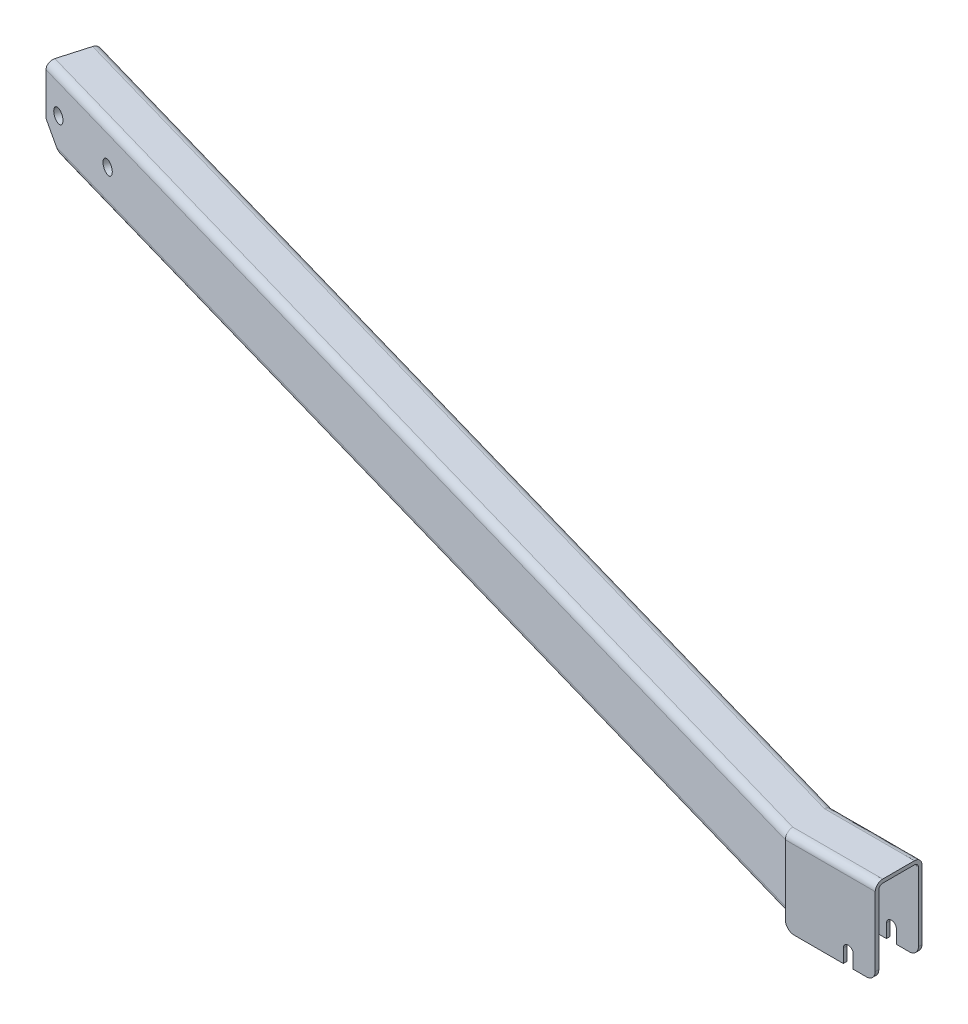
ISO-10303-21;
HEADER;
FILE_DESCRIPTION(('STEP AP214'),'2;1');
FILE_NAME('part.step','',(''),(''),'','','');
FILE_SCHEMA(('AUTOMOTIVE_DESIGN { 1 0 10303 214 1 1 1 1 }'));
ENDSEC;
DATA;
#1=APPLICATION_CONTEXT('core data for automotive mechanical design processes');
#2=APPLICATION_PROTOCOL_DEFINITION('international standard','automotive_design',2000,#1);
#3=PRODUCT_CONTEXT('',#1,'mechanical');
#4=PRODUCT('Part','Part','',(#3));
#5=PRODUCT_RELATED_PRODUCT_CATEGORY('part','',(#4));
#6=PRODUCT_DEFINITION_FORMATION('','',#4);
#7=PRODUCT_DEFINITION_CONTEXT('part definition',#1,'design');
#8=PRODUCT_DEFINITION('design','',#6,#7);
#9=PRODUCT_DEFINITION_SHAPE('','',#8);
#10=(LENGTH_UNIT() NAMED_UNIT(*) SI_UNIT(.MILLI.,.METRE.));
#11=(NAMED_UNIT(*) PLANE_ANGLE_UNIT() SI_UNIT($,.RADIAN.));
#12=(NAMED_UNIT(*) SI_UNIT($,.STERADIAN.) SOLID_ANGLE_UNIT());
#13=UNCERTAINTY_MEASURE_WITH_UNIT(LENGTH_MEASURE(1.E-05),#10,'distance_accuracy_value','');
#14=(GEOMETRIC_REPRESENTATION_CONTEXT(3) GLOBAL_UNCERTAINTY_ASSIGNED_CONTEXT((#13)) GLOBAL_UNIT_ASSIGNED_CONTEXT((#10,
#11,#12)) REPRESENTATION_CONTEXT('',''));
#15=CARTESIAN_POINT('',(0.,0.,0.));
#16=DIRECTION('',(0.,0.,1.));
#17=DIRECTION('',(1.,0.,0.));
#18=AXIS2_PLACEMENT_3D('',#15,#16,#17);
#19=CARTESIAN_POINT('',(1125.5,-40.,-51.5953029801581));
#20=DIRECTION('',(1.,0.,0.));
#21=DIRECTION('',(0.,0.,-1.));
#22=AXIS2_PLACEMENT_3D('',#19,#20,#21);
#23=PLANE('',#22);
#24=DIRECTION('',(0.,1.,0.));
#25=VECTOR('',#24,1.);
#26=CARTESIAN_POINT('',(1125.5,31.9999999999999,275.075169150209));
#27=LINE('',#26,#25);
#28=CARTESIAN_POINT('',(1125.5,-55.,275.075169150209));
#29=VERTEX_POINT('',#28);
#30=CARTESIAN_POINT('',(1125.5,-40.,275.075169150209));
#31=VERTEX_POINT('',#30);
#32=EDGE_CURVE('E332',#29,#31,#27,.T.);
#33=ORIENTED_EDGE('',*,*,#32,.F.);
#34=DIRECTION('',(0.,0.,-1.));
#35=VECTOR('',#34,1.);
#36=CARTESIAN_POINT('',(1125.5,-55.,275.075169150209));
#37=LINE('',#36,#35);
#38=CARTESIAN_POINT('',(1125.5,-55.,279.075169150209));
#39=VERTEX_POINT('',#38);
#40=EDGE_CURVE('E283',#39,#29,#37,.T.);
#41=ORIENTED_EDGE('',*,*,#40,.F.);
#42=DIRECTION('',(0.,1.,0.));
#43=VECTOR('',#42,1.);
#44=CARTESIAN_POINT('',(1125.5,31.9999999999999,279.075169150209));
#45=LINE('',#44,#43);
#46=CARTESIAN_POINT('',(1125.5,-40.,279.075169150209));
#47=VERTEX_POINT('',#46);
#48=EDGE_CURVE('E862',#39,#47,#45,.T.);
#49=ORIENTED_EDGE('',*,*,#48,.T.);
#50=DIRECTION('',(0.,0.,1.));
#51=VECTOR('',#50,1.);
#52=CARTESIAN_POINT('',(1125.5,-40.,-51.5953029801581));
#53=LINE('',#52,#51);
#54=EDGE_CURVE('E856',#47,#31,#53,.F.);
#55=ORIENTED_EDGE('',*,*,#54,.T.);
#56=EDGE_LOOP('',(#33,#41,#49,#55));
#57=FACE_BOUND('',#56,.T.);
#58=ADVANCED_FACE('F15',(#57),#23,.F.);
#59=CARTESIAN_POINT('',(1120.,-40.,-51.5953029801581));
#60=DIRECTION('',(0.,0.,1.));
#61=DIRECTION('',(1.,0.,0.));
#62=AXIS2_PLACEMENT_3D('',#59,#60,#61);
#63=CYLINDRICAL_SURFACE('',#62,5.50000000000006);
#64=CARTESIAN_POINT('',(1120.,-40.,275.075169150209));
#65=DIRECTION('',(0.,0.,1.));
#66=DIRECTION('',(1.,0.,0.));
#67=AXIS2_PLACEMENT_3D('',#64,#65,#66);
#68=CIRCLE('',#67,5.50000000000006);
#69=CARTESIAN_POINT('',(1114.5,-40.,275.075169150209));
#70=VERTEX_POINT('',#69);
#71=EDGE_CURVE('E329',#31,#70,#68,.T.);
#72=ORIENTED_EDGE('',*,*,#71,.F.);
#73=ORIENTED_EDGE('',*,*,#54,.F.);
#74=CARTESIAN_POINT('',(1120.,-40.,279.075169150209));
#75=DIRECTION('',(0.,0.,1.));
#76=DIRECTION('',(1.,0.,0.));
#77=AXIS2_PLACEMENT_3D('',#74,#75,#76);
#78=CIRCLE('',#77,5.50000000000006);
#79=CARTESIAN_POINT('',(1114.5,-40.,279.075169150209));
#80=VERTEX_POINT('',#79);
#81=EDGE_CURVE('E849',#47,#80,#78,.T.);
#82=ORIENTED_EDGE('',*,*,#81,.T.);
#83=DIRECTION('',(0.,0.,1.));
#84=VECTOR('',#83,1.);
#85=CARTESIAN_POINT('',(1114.5,-40.,-51.5953029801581));
#86=LINE('',#85,#84);
#87=EDGE_CURVE('E852',#80,#70,#86,.F.);
#88=ORIENTED_EDGE('',*,*,#87,.T.);
#89=EDGE_LOOP('',(#72,#73,#82,#88));
#90=FACE_BOUND('',#89,.T.);
#91=ADVANCED_FACE('F866',(#90),#63,.F.);
#92=CARTESIAN_POINT('',(1114.5,-40.,-51.5953029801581));
#93=DIRECTION('',(-1.,0.,0.));
#94=DIRECTION('',(0.,-1.,0.));
#95=AXIS2_PLACEMENT_3D('',#92,#93,#94);
#96=PLANE('',#95);
#97=DIRECTION('',(0.,1.,0.));
#98=VECTOR('',#97,1.);
#99=CARTESIAN_POINT('',(1114.5,31.9999999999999,275.075169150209));
#100=LINE('',#99,#98);
#101=CARTESIAN_POINT('',(1114.5,-55.,275.075169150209));
#102=VERTEX_POINT('',#101);
#103=EDGE_CURVE('E325',#70,#102,#100,.F.);
#104=ORIENTED_EDGE('',*,*,#103,.F.);
#105=ORIENTED_EDGE('',*,*,#87,.F.);
#106=DIRECTION('',(0.,1.,0.));
#107=VECTOR('',#106,1.);
#108=CARTESIAN_POINT('',(1114.5,31.9999999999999,279.075169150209));
#109=LINE('',#108,#107);
#110=CARTESIAN_POINT('',(1114.5,-55.,279.075169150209));
#111=VERTEX_POINT('',#110);
#112=EDGE_CURVE('E298',#80,#111,#109,.F.);
#113=ORIENTED_EDGE('',*,*,#112,.T.);
#114=DIRECTION('',(0.,0.,-1.));
#115=VECTOR('',#114,1.);
#116=CARTESIAN_POINT('',(1114.5,-55.,275.075169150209));
#117=LINE('',#116,#115);
#118=EDGE_CURVE('E284',#102,#111,#117,.F.);
#119=ORIENTED_EDGE('',*,*,#118,.F.);
#120=EDGE_LOOP('',(#104,#105,#113,#119));
#121=FACE_BOUND('',#120,.T.);
#122=ADVANCED_FACE('F886',(#121),#96,.F.);
#123=CARTESIAN_POINT('',(1150.,-55.,275.075169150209));
#124=DIRECTION('',(0.,-1.,0.));
#125=DIRECTION('',(0.,0.,-1.));
#126=AXIS2_PLACEMENT_3D('',#123,#124,#125);
#127=PLANE('',#126);
#128=DIRECTION('',(0.,0.,1.));
#129=VECTOR('',#128,1.);
#130=CARTESIAN_POINT('',(1060.,-55.,283.397564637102));
#131=LINE('',#130,#129);
#132=CARTESIAN_POINT('',(1060.,-55.,275.075169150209));
#133=VERTEX_POINT('',#132);
#134=CARTESIAN_POINT('',(1060.,-55.,279.075169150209));
#135=VERTEX_POINT('',#134);
#136=EDGE_CURVE('E274',#133,#135,#131,.T.);
#137=ORIENTED_EDGE('',*,*,#136,.F.);
#138=DIRECTION('',(-1.,0.,0.));
#139=VECTOR('',#138,1.);
#140=CARTESIAN_POINT('',(1150.,-55.,275.075169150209));
#141=LINE('',#140,#139);
#142=EDGE_CURVE('E323',#102,#133,#141,.T.);
#143=ORIENTED_EDGE('',*,*,#142,.F.);
#144=ORIENTED_EDGE('',*,*,#118,.T.);
#145=DIRECTION('',(-1.,0.,0.));
#146=VECTOR('',#145,1.);
#147=CARTESIAN_POINT('',(1150.,-55.,279.075169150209));
#148=LINE('',#147,#146);
#149=EDGE_CURVE('E291',#111,#135,#148,.T.);
#150=ORIENTED_EDGE('',*,*,#149,.T.);
#151=EDGE_LOOP('',(#137,#143,#144,#150));
#152=FACE_BOUND('',#151,.T.);
#153=ADVANCED_FACE('F296',(#152),#127,.T.);
#154=CARTESIAN_POINT('',(1060.,-45.,283.397564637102));
#155=DIRECTION('',(0.,0.,1.));
#156=DIRECTION('',(1.,0.,0.));
#157=AXIS2_PLACEMENT_3D('',#154,#155,#156);
#158=CYLINDRICAL_SURFACE('',#157,10.);
#159=CARTESIAN_POINT('',(1060.,-45.,279.075169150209));
#160=DIRECTION('',(0.,0.,1.));
#161=DIRECTION('',(1.,0.,0.));
#162=AXIS2_PLACEMENT_3D('',#159,#160,#161);
#163=CIRCLE('',#162,10.);
#164=CARTESIAN_POINT('',(1050.,-45.,279.075169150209));
#165=VERTEX_POINT('',#164);
#166=EDGE_CURVE('E22',#135,#165,#163,.F.);
#167=ORIENTED_EDGE('',*,*,#166,.T.);
#168=DIRECTION('',(0.,0.,1.));
#169=VECTOR('',#168,1.);
#170=CARTESIAN_POINT('',(1050.,-45.,283.397564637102));
#171=LINE('',#170,#169);
#172=CARTESIAN_POINT('',(1050.,-45.,275.075169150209));
#173=VERTEX_POINT('',#172);
#174=EDGE_CURVE('E312',#173,#165,#171,.T.);
#175=ORIENTED_EDGE('',*,*,#174,.F.);
#176=CARTESIAN_POINT('',(1060.,-45.,275.075169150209));
#177=DIRECTION('',(0.,0.,1.));
#178=DIRECTION('',(1.,0.,0.));
#179=AXIS2_PLACEMENT_3D('',#176,#177,#178);
#180=CIRCLE('',#179,10.);
#181=EDGE_CURVE('E279',#133,#173,#180,.F.);
#182=ORIENTED_EDGE('',*,*,#181,.F.);
#183=ORIENTED_EDGE('',*,*,#136,.T.);
#184=EDGE_LOOP('',(#167,#175,#182,#183));
#185=FACE_BOUND('',#184,.T.);
#186=ADVANCED_FACE('F276',(#185),#158,.T.);
#187=CARTESIAN_POINT('',(1150.,-55.,275.075169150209));
#188=DIRECTION('',(0.,-1.,0.));
#189=DIRECTION('',(0.,0.,-1.));
#190=AXIS2_PLACEMENT_3D('',#187,#188,#189);
#191=PLANE('',#190);
#192=DIRECTION('',(0.,0.,-1.));
#193=VECTOR('',#192,1.);
#194=CARTESIAN_POINT('',(1140.,-55.,275.075169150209));
#195=LINE('',#194,#193);
#196=CARTESIAN_POINT('',(1140.,-55.,279.075169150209));
#197=VERTEX_POINT('',#196);
#198=CARTESIAN_POINT('',(1140.,-55.,275.075169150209));
#199=VERTEX_POINT('',#198);
#200=EDGE_CURVE('E300',#197,#199,#195,.T.);
#201=ORIENTED_EDGE('',*,*,#200,.F.);
#202=DIRECTION('',(-1.,0.,0.));
#203=VECTOR('',#202,1.);
#204=CARTESIAN_POINT('',(1150.,-55.,279.075169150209));
#205=LINE('',#204,#203);
#206=EDGE_CURVE('E874',#197,#39,#205,.T.);
#207=ORIENTED_EDGE('',*,*,#206,.T.);
#208=ORIENTED_EDGE('',*,*,#40,.T.);
#209=DIRECTION('',(-1.,0.,0.));
#210=VECTOR('',#209,1.);
#211=CARTESIAN_POINT('',(1150.,-55.,275.075169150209));
#212=LINE('',#211,#210);
#213=EDGE_CURVE('E313',#199,#29,#212,.T.);
#214=ORIENTED_EDGE('',*,*,#213,.F.);
#215=EDGE_LOOP('',(#201,#207,#208,#214));
#216=FACE_BOUND('',#215,.T.);
#217=ADVANCED_FACE('F882',(#216),#191,.T.);
#218=CARTESIAN_POINT('',(1140.,-45.,275.075169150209));
#219=DIRECTION('',(0.,0.,-1.));
#220=DIRECTION('',(-1.,0.,0.));
#221=AXIS2_PLACEMENT_3D('',#218,#219,#220);
#222=CYLINDRICAL_SURFACE('',#221,10.);
#223=CARTESIAN_POINT('',(1140.,-45.,279.075169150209));
#224=DIRECTION('',(0.,0.,-1.));
#225=DIRECTION('',(-1.,0.,0.));
#226=AXIS2_PLACEMENT_3D('',#223,#224,#225);
#227=CIRCLE('',#226,10.);
#228=CARTESIAN_POINT('',(1150.,-45.,279.075169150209));
#229=VERTEX_POINT('',#228);
#230=EDGE_CURVE('E295',#229,#197,#227,.T.);
#231=ORIENTED_EDGE('',*,*,#230,.T.);
#232=ORIENTED_EDGE('',*,*,#200,.T.);
#233=CARTESIAN_POINT('',(1140.,-45.,275.075169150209));
#234=DIRECTION('',(0.,0.,-1.));
#235=DIRECTION('',(-1.,0.,0.));
#236=AXIS2_PLACEMENT_3D('',#233,#234,#235);
#237=CIRCLE('',#236,10.);
#238=CARTESIAN_POINT('',(1150.,-45.,275.075169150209));
#239=VERTEX_POINT('',#238);
#240=EDGE_CURVE('E317',#239,#199,#237,.T.);
#241=ORIENTED_EDGE('',*,*,#240,.F.);
#242=DIRECTION('',(0.,0.,1.));
#243=VECTOR('',#242,1.);
#244=CARTESIAN_POINT('',(1150.,-45.,283.397564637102));
#245=LINE('',#244,#243);
#246=EDGE_CURVE('E346',#239,#229,#245,.T.);
#247=ORIENTED_EDGE('',*,*,#246,.T.);
#248=EDGE_LOOP('',(#231,#232,#241,#247));
#249=FACE_BOUND('',#248,.T.);
#250=ADVANCED_FACE('F1195',(#249),#222,.T.);
#251=CARTESIAN_POINT('',(1150.,31.9999999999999,279.075169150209));
#252=DIRECTION('',(0.,0.,-1.));
#253=DIRECTION('',(-1.,0.,0.));
#254=AXIS2_PLACEMENT_3D('',#251,#252,#253);
#255=PLANE('',#254);
#256=ORIENTED_EDGE('',*,*,#48,.F.);
#257=ORIENTED_EDGE('',*,*,#206,.F.);
#258=ORIENTED_EDGE('',*,*,#230,.F.);
#259=DIRECTION('',(0.,1.,0.));
#260=VECTOR('',#259,1.);
#261=CARTESIAN_POINT('',(1150.,32.,279.075169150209));
#262=LINE('',#261,#260);
#263=CARTESIAN_POINT('',(1150.,32.,279.075169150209));
#264=VERTEX_POINT('',#263);
#265=EDGE_CURVE('E342',#229,#264,#262,.T.);
#266=ORIENTED_EDGE('',*,*,#265,.T.);
#267=DIRECTION('',(-1.,0.,0.));
#268=VECTOR('',#267,1.);
#269=CARTESIAN_POINT('',(1100.,32.,279.075169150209));
#270=LINE('',#269,#268);
#271=CARTESIAN_POINT('',(1050.,32.,279.075169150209));
#272=VERTEX_POINT('',#271);
#273=EDGE_CURVE('E311',#264,#272,#270,.T.);
#274=ORIENTED_EDGE('',*,*,#273,.T.);
#275=DIRECTION('',(0.,1.,0.));
#276=VECTOR('',#275,1.);
#277=CARTESIAN_POINT('',(1050.,0.,279.075169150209));
#278=LINE('',#277,#276);
#279=CARTESIAN_POINT('',(1050.,-38.8363999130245,279.075169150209));
#280=VERTEX_POINT('',#279);
#281=EDGE_CURVE('E355',#280,#272,#278,.T.);
#282=ORIENTED_EDGE('',*,*,#281,.F.);
#283=DIRECTION('',(0.,1.,0.));
#284=VECTOR('',#283,1.);
#285=CARTESIAN_POINT('',(1050.,32.,279.075169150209));
#286=LINE('',#285,#284);
#287=EDGE_CURVE('E294',#165,#280,#286,.T.);
#288=ORIENTED_EDGE('',*,*,#287,.F.);
#289=ORIENTED_EDGE('',*,*,#166,.F.);
#290=ORIENTED_EDGE('',*,*,#149,.F.);
#291=ORIENTED_EDGE('',*,*,#112,.F.);
#292=ORIENTED_EDGE('',*,*,#81,.F.);
#293=EDGE_LOOP('',(#256,#257,#258,#266,#274,#282,#288,#289,#290,#291,#292));
#294=FACE_BOUND('',#293,.T.);
#295=ADVANCED_FACE('F289',(#294),#255,.F.);
#296=CARTESIAN_POINT('',(1150.,31.9999999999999,323.090140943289));
#297=DIRECTION('',(0.,0.,1.));
#298=DIRECTION('',(1.,0.,0.));
#299=AXIS2_PLACEMENT_3D('',#296,#297,#298);
#300=PLANE('',#299);
#301=DIRECTION('',(0.,1.,0.));
#302=VECTOR('',#301,1.);
#303=CARTESIAN_POINT('',(1125.5,-40.,323.090140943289));
#304=LINE('',#303,#302);
#305=CARTESIAN_POINT('',(1125.5,-55.,323.090140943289));
#306=VERTEX_POINT('',#305);
#307=CARTESIAN_POINT('',(1125.5,-40.,323.090140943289));
#308=VERTEX_POINT('',#307);
#309=EDGE_CURVE('E316',#306,#308,#304,.T.);
#310=ORIENTED_EDGE('',*,*,#309,.T.);
#311=CARTESIAN_POINT('',(1120.,-40.,323.090140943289));
#312=DIRECTION('',(0.,0.,1.));
#313=DIRECTION('',(1.,0.,0.));
#314=AXIS2_PLACEMENT_3D('',#311,#312,#313);
#315=CIRCLE('',#314,5.50000000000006);
#316=CARTESIAN_POINT('',(1114.5,-40.,323.090140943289));
#317=VERTEX_POINT('',#316);
#318=EDGE_CURVE('E598',#308,#317,#315,.T.);
#319=ORIENTED_EDGE('',*,*,#318,.T.);
#320=DIRECTION('',(0.,-1.,0.));
#321=VECTOR('',#320,1.);
#322=CARTESIAN_POINT('',(1114.5,-40.,323.090140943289));
#323=LINE('',#322,#321);
#324=CARTESIAN_POINT('',(1114.5,-55.,323.090140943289));
#325=VERTEX_POINT('',#324);
#326=EDGE_CURVE('E604',#317,#325,#323,.T.);
#327=ORIENTED_EDGE('',*,*,#326,.T.);
#328=DIRECTION('',(1.,0.,0.));
#329=VECTOR('',#328,1.);
#330=CARTESIAN_POINT('',(1150.,-55.,323.090140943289));
#331=LINE('',#330,#329);
#332=CARTESIAN_POINT('',(1060.,-55.,323.090140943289));
#333=VERTEX_POINT('',#332);
#334=EDGE_CURVE('E610',#333,#325,#331,.T.);
#335=ORIENTED_EDGE('',*,*,#334,.F.);
#336=CARTESIAN_POINT('',(1060.,-45.,323.090140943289));
#337=DIRECTION('',(0.,0.,1.));
#338=DIRECTION('',(1.,0.,0.));
#339=AXIS2_PLACEMENT_3D('',#336,#337,#338);
#340=CIRCLE('',#339,10.);
#341=CARTESIAN_POINT('',(1050.,-45.,323.090140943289));
#342=VERTEX_POINT('',#341);
#343=EDGE_CURVE('E611',#342,#333,#340,.T.);
#344=ORIENTED_EDGE('',*,*,#343,.F.);
#345=DIRECTION('',(0.,1.,0.));
#346=VECTOR('',#345,1.);
#347=CARTESIAN_POINT('',(1050.,32.,323.090140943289));
#348=LINE('',#347,#346);
#349=CARTESIAN_POINT('',(1050.,-38.8363999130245,323.090140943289));
#350=VERTEX_POINT('',#349);
#351=EDGE_CURVE('E353',#350,#342,#348,.F.);
#352=ORIENTED_EDGE('',*,*,#351,.F.);
#353=DIRECTION('',(0.,1.,0.));
#354=VECTOR('',#353,1.);
#355=CARTESIAN_POINT('',(1050.,0.,323.090140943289));
#356=LINE('',#355,#354);
#357=CARTESIAN_POINT('',(1050.,32.,323.090140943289));
#358=VERTEX_POINT('',#357);
#359=EDGE_CURVE('E351',#358,#350,#356,.F.);
#360=ORIENTED_EDGE('',*,*,#359,.F.);
#361=DIRECTION('',(1.,0.,0.));
#362=VECTOR('',#361,1.);
#363=CARTESIAN_POINT('',(1100.,32.,323.090140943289));
#364=LINE('',#363,#362);
#365=CARTESIAN_POINT('',(1150.,32.,323.090140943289));
#366=VERTEX_POINT('',#365);
#367=EDGE_CURVE('E334',#358,#366,#364,.T.);
#368=ORIENTED_EDGE('',*,*,#367,.T.);
#369=DIRECTION('',(0.,1.,0.));
#370=VECTOR('',#369,1.);
#371=CARTESIAN_POINT('',(1150.,32.,323.090140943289));
#372=LINE('',#371,#370);
#373=CARTESIAN_POINT('',(1150.,-45.,323.090140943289));
#374=VERTEX_POINT('',#373);
#375=EDGE_CURVE('E337',#366,#374,#372,.F.);
#376=ORIENTED_EDGE('',*,*,#375,.T.);
#377=CARTESIAN_POINT('',(1140.,-45.,323.090140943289));
#378=DIRECTION('',(0.,0.,-1.));
#379=DIRECTION('',(-1.,0.,0.));
#380=AXIS2_PLACEMENT_3D('',#377,#378,#379);
#381=CIRCLE('',#380,10.);
#382=CARTESIAN_POINT('',(1140.,-55.,323.090140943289));
#383=VERTEX_POINT('',#382);
#384=EDGE_CURVE('E620',#383,#374,#381,.F.);
#385=ORIENTED_EDGE('',*,*,#384,.F.);
#386=DIRECTION('',(1.,0.,0.));
#387=VECTOR('',#386,1.);
#388=CARTESIAN_POINT('',(1150.,-55.,323.090140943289));
#389=LINE('',#388,#387);
#390=EDGE_CURVE('E624',#306,#383,#389,.T.);
#391=ORIENTED_EDGE('',*,*,#390,.F.);
#392=EDGE_LOOP('',(#310,#319,#327,#335,#344,#352,#360,#368,#376,#385,#391));
#393=FACE_BOUND('',#392,.T.);
#394=ADVANCED_FACE('F964',(#393),#300,.F.);
#395=CARTESIAN_POINT('',(1050.,32.,283.397564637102));
#396=DIRECTION('',(-1.,0.,0.));
#397=DIRECTION('',(0.,0.,1.));
#398=AXIS2_PLACEMENT_3D('',#395,#396,#397);
#399=PLANE('',#398);
#400=ORIENTED_EDGE('',*,*,#287,.T.);
#401=CARTESIAN_POINT('',(1050.,-32.,283.397564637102));
#402=DIRECTION('',(-1.,0.,0.));
#403=DIRECTION('',(0.,0.,-1.));
#404=AXIS2_PLACEMENT_3D('',#401,#402,#403);
#405=ELLIPSE('',#404,8.32239548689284,8.00000000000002);
#406=CARTESIAN_POINT('',(1050.,-32.,275.075169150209));
#407=VERTEX_POINT('',#406);
#408=EDGE_CURVE('E368',#407,#280,#405,.T.);
#409=ORIENTED_EDGE('',*,*,#408,.F.);
#410=DIRECTION('',(0.,1.,0.));
#411=VECTOR('',#410,1.);
#412=CARTESIAN_POINT('',(1050.,31.9999999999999,275.075169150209));
#413=LINE('',#412,#411);
#414=EDGE_CURVE('E320',#173,#407,#413,.T.);
#415=ORIENTED_EDGE('',*,*,#414,.F.);
#416=ORIENTED_EDGE('',*,*,#174,.T.);
#417=EDGE_LOOP('',(#400,#409,#415,#416));
#418=FACE_BOUND('',#417,.T.);
#419=ADVANCED_FACE('F894',(#418),#399,.T.);
#420=CARTESIAN_POINT('',(1150.,40.,283.397564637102));
#421=CARTESIAN_POINT('',(1116.66666666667,40.,283.397564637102));
#422=CARTESIAN_POINT('',(1083.33333333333,40.,283.397564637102));
#423=CARTESIAN_POINT('',(1050.,40.,283.397564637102));
#424=CARTESIAN_POINT('',(1150.,40.,278.522418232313));
#425=CARTESIAN_POINT('',(1116.66666666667,40.,278.522418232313));
#426=CARTESIAN_POINT('',(1083.33333333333,40.,278.522418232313));
#427=CARTESIAN_POINT('',(1050.,40.,278.522418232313));
#428=CARTESIAN_POINT('',(1150.,36.6862915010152,275.075169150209));
#429=CARTESIAN_POINT('',(1116.66666666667,36.6862915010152,275.075169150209));
#430=CARTESIAN_POINT('',(1083.33333333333,36.6862915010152,275.075169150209));
#431=CARTESIAN_POINT('',(1050.,36.6862915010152,275.075169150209));
#432=CARTESIAN_POINT('',(1150.,31.9999999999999,275.075169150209));
#433=CARTESIAN_POINT('',(1116.66666666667,31.9999999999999,275.075169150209));
#434=CARTESIAN_POINT('',(1083.33333333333,31.9999999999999,275.075169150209));
#435=CARTESIAN_POINT('',(1050.,31.9999999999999,275.075169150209));
#436=(BOUNDED_SURFACE() B_SPLINE_SURFACE(3,3,((#420,#421,#422,#423),(#424,#425,#426,#427),(#428,
#429,#430,#431),(#432,#433,#434,#435)),.UNSPECIFIED.,.F.,.F.,
.F.) B_SPLINE_SURFACE_WITH_KNOTS((4,4),(4,4),(0.,1.),(0.,1.),
.UNSPECIFIED.) GEOMETRIC_REPRESENTATION_ITEM() RATIONAL_B_SPLINE_SURFACE(((1.,1.,1.,1.),
(0.804737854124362,0.804737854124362,0.804737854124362,0.804737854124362),(0.804737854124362,
0.804737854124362,0.804737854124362,0.804737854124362),(1.,1.,1.,1.))) REPRESENTATION_ITEM('') SURFACE());
#437=CARTESIAN_POINT('',(1150.,40.,283.397564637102));
#438=CARTESIAN_POINT('',(1150.,40.0000192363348,283.156294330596));
#439=CARTESIAN_POINT('',(1150.,39.9899153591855,282.915024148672));
#440=CARTESIAN_POINT('',(1150.,39.9495982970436,282.434162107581));
#441=CARTESIAN_POINT('',(1150.,39.9193844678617,282.194570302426));
#442=CARTESIAN_POINT('',(1150.,39.8389669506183,281.718655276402));
#443=CARTESIAN_POINT('',(1150.,39.7887545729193,281.482333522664));
#444=CARTESIAN_POINT('',(1150.,39.6686187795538,281.014758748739));
#445=CARTESIAN_POINT('',(1150.,39.598695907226,280.783505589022));
#446=CARTESIAN_POINT('',(1150.,39.4394500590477,280.327535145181));
#447=CARTESIAN_POINT('',(1150.,39.3501092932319,280.102824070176));
#448=CARTESIAN_POINT('',(1150.,39.1525758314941,279.661841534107));
#449=CARTESIAN_POINT('',(1150.,39.0443831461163,279.445570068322));
#450=CARTESIAN_POINT('',(1150.,38.8098420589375,279.02323465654));
#451=CARTESIAN_POINT('',(1150.,38.6835022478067,278.817165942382));
#452=CARTESIAN_POINT('',(1150.,38.4134094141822,278.416773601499));
#453=CARTESIAN_POINT('',(1150.,38.2696568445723,278.222449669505));
#454=CARTESIAN_POINT('',(1150.,37.9686794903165,277.850873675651));
#455=CARTESIAN_POINT('',(1150.,37.8117782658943,277.673359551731));
#456=CARTESIAN_POINT('',(1150.,37.4831559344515,277.332626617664));
#457=CARTESIAN_POINT('',(1150.,37.311435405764,277.169407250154));
#458=CARTESIAN_POINT('',(1150.,36.9543026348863,276.858631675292));
#459=CARTESIAN_POINT('',(1150.,36.768888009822,276.711078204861));
#460=CARTESIAN_POINT('',(1150.,36.3857131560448,276.432988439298));
#461=CARTESIAN_POINT('',(1150.,36.18795359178,276.302451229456));
#462=CARTESIAN_POINT('',(1150.,35.7892334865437,276.064187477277));
#463=CARTESIAN_POINT('',(1150.,35.588676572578,275.955785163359));
#464=CARTESIAN_POINT('',(1150.,35.1789151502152,275.756806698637));
#465=CARTESIAN_POINT('',(1150.,34.9697111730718,275.666229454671));
#466=CARTESIAN_POINT('',(1150.,34.544377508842,275.503795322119));
#467=CARTESIAN_POINT('',(1150.,34.3282545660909,275.431920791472));
#468=CARTESIAN_POINT('',(1150.,33.8906163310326,275.307470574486));
#469=CARTESIAN_POINT('',(1150.,33.669102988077,275.254888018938));
#470=CARTESIAN_POINT('',(1150.,33.2074157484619,275.166646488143));
#471=CARTESIAN_POINT('',(1150.,32.9669790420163,275.132342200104));
#472=CARTESIAN_POINT('',(1150.,32.6049610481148,275.098041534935));
#473=CARTESIAN_POINT('',(1150.,32.4841342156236,275.089467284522));
#474=CARTESIAN_POINT('',(1150.,32.2422113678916,275.078031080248));
#475=CARTESIAN_POINT('',(1150.,32.1211153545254,275.075169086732));
#476=CARTESIAN_POINT('',(1150.,31.9999999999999,275.075169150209));
#477=B_SPLINE_CURVE_WITH_KNOTS('',3,(#437,#438,#439,#440,#441,#442,#443,#444,#445,#446,#447,
#448,#449,#450,#451,#452,#453,#454,#455,#456,#457,#458,#459,#460,#461,#462,#463,#464,#465,#466,
#467,#468,#469,#470,#471,#472,#473,#474,#475,#476),.UNSPECIFIED.,.F.,.F.,(4,2,2,2,2,2,2,2,2,2,2,
2,2,2,2,2,2,2,2,4),(0.,0.723599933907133,1.44722304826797,2.17116093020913,2.89507885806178,
3.61966282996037,4.34424639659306,5.06848807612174,5.79271092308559,6.50257701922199,
7.21241542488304,7.92237764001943,8.63230167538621,9.31538810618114,9.99843263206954,
10.6808304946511,11.3629851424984,12.0904099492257,12.4536861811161,12.8169598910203),.UNSPECIFIED.);
#478=CARTESIAN_POINT('',(1150.,40.,283.397564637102));
#479=VERTEX_POINT('',#478);
#480=CARTESIAN_POINT('',(1150.,31.9999999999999,275.075169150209));
#481=VERTEX_POINT('',#480);
#482=EDGE_CURVE('E350',#479,#481,#477,.T.);
#483=DIRECTION('',(-1.,0.,0.));
#484=VECTOR('',#483,1.);
#485=CARTESIAN_POINT('',(1150.,31.9999999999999,275.075169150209));
#486=LINE('',#485,#484);
#487=CARTESIAN_POINT('',(1050.,31.9999999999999,275.075169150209));
#488=VERTEX_POINT('',#487);
#489=EDGE_CURVE('E322',#488,#481,#486,.F.);
#490=CARTESIAN_POINT('',(1050.,31.9999999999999,275.075169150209));
#491=CARTESIAN_POINT('',(1050.,36.6862915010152,275.075169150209));
#492=CARTESIAN_POINT('',(1050.,40.,278.522418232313));
#493=CARTESIAN_POINT('',(1050.,40.,283.397564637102));
#494=(BOUNDED_CURVE() B_SPLINE_CURVE(3,(#490,#491,#492,#493),.UNSPECIFIED.,.F.,
.F.) B_SPLINE_CURVE_WITH_KNOTS((4,4),(0.,1.),
.UNSPECIFIED.) CURVE() GEOMETRIC_REPRESENTATION_ITEM() RATIONAL_B_SPLINE_CURVE((1.,
0.804737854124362,0.804737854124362,1.)) REPRESENTATION_ITEM(''));
#495=CARTESIAN_POINT('',(1050.,40.,283.397564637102));
#496=VERTEX_POINT('',#495);
#497=EDGE_CURVE('E374',#496,#488,#494,.F.);
#498=DIRECTION('',(1.,0.,0.));
#499=VECTOR('',#498,1.);
#500=CARTESIAN_POINT('',(1137.82669412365,40.,283.397564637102));
#501=LINE('',#500,#499);
#502=EDGE_CURVE('E578',#496,#479,#501,.T.);
#503=ORIENTED_EDGE('',*,*,#482,.T.);
#504=ORIENTED_EDGE('',*,*,#489,.F.);
#505=ORIENTED_EDGE('',*,*,#497,.F.);
#506=ORIENTED_EDGE('',*,*,#502,.T.);
#507=EDGE_LOOP('',(#503,#504,#505,#506));
#508=FACE_BOUND('',#507,.T.);
#509=ADVANCED_FACE('F695',(#508),#436,.T.);
#510=CARTESIAN_POINT('',(1150.,36.,283.397564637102));
#511=CARTESIAN_POINT('',(1116.66666666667,36.,283.397564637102));
#512=CARTESIAN_POINT('',(1083.33333333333,36.,283.397564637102));
#513=CARTESIAN_POINT('',(1050.,36.,283.397564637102));
#514=CARTESIAN_POINT('',(1150.,36.,282.811481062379));
#515=CARTESIAN_POINT('',(1116.66666666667,36.,282.811481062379));
#516=CARTESIAN_POINT('',(1083.33333333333,36.,282.811481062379));
#517=CARTESIAN_POINT('',(1050.,36.,282.811481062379));
#518=CARTESIAN_POINT('',(1150.,35.8872484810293,282.22601286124));
#519=CARTESIAN_POINT('',(1116.66666666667,35.8872484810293,282.22601286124));
#520=CARTESIAN_POINT('',(1083.33333333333,35.8872484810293,282.22601286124));
#521=CARTESIAN_POINT('',(1050.,35.8872484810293,282.22601286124));
#522=CARTESIAN_POINT('',(1150.,35.4623235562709,281.158811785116));
#523=CARTESIAN_POINT('',(1116.66666666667,35.4623235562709,281.158811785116));
#524=CARTESIAN_POINT('',(1083.33333333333,35.4623235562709,281.158811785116));
#525=CARTESIAN_POINT('',(1050.,35.4623235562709,281.158811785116));
#526=CARTESIAN_POINT('',(1150.,35.1510301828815,280.677898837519));
#527=CARTESIAN_POINT('',(1116.66666666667,35.1510301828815,280.677898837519));
#528=CARTESIAN_POINT('',(1083.33333333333,35.1510301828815,280.677898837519));
#529=CARTESIAN_POINT('',(1050.,35.1510301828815,280.677898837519));
#530=CARTESIAN_POINT('',(1150.,34.3952163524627,279.891626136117));
#531=CARTESIAN_POINT('',(1116.66666666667,34.3952163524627,279.891626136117));
#532=CARTESIAN_POINT('',(1083.33333333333,34.3952163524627,279.891626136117));
#533=CARTESIAN_POINT('',(1050.,34.3952163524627,279.891626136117));
#534=CARTESIAN_POINT('',(1150.,33.9517498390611,279.586047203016));
#535=CARTESIAN_POINT('',(1116.66666666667,33.9517498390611,279.586047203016));
#536=CARTESIAN_POINT('',(1083.33333333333,33.9517498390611,279.586047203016));
#537=CARTESIAN_POINT('',(1050.,33.9517498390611,279.586047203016));
#538=CARTESIAN_POINT('',(1150.,33.0053455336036,279.178235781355));
#539=CARTESIAN_POINT('',(1116.66666666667,33.0053455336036,279.178235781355));
#540=CARTESIAN_POINT('',(1083.33333333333,33.0053455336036,279.178235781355));
#541=CARTESIAN_POINT('',(1050.,33.0053455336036,279.178235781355));
#542=CARTESIAN_POINT('',(1150.,32.5024980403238,279.075169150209));
#543=CARTESIAN_POINT('',(1116.66666666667,32.5024980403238,279.075169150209));
#544=CARTESIAN_POINT('',(1083.33333333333,32.5024980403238,279.075169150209));
#545=CARTESIAN_POINT('',(1050.,32.5024980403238,279.075169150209));
#546=CARTESIAN_POINT('',(1150.,32.,279.075169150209));
#547=CARTESIAN_POINT('',(1116.66666666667,32.,279.075169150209));
#548=CARTESIAN_POINT('',(1083.33333333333,32.,279.075169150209));
#549=CARTESIAN_POINT('',(1050.,32.,279.075169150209));
#550=B_SPLINE_SURFACE_WITH_KNOTS('',3,3,((#510,#511,#512,#513),(#514,#515,#516,#517),(#518,#519,
#520,#521),(#522,#523,#524,#525),(#526,#527,#528,#529),(#530,#531,#532,#533),(#534,#535,#536,
#537),(#538,#539,#540,#541),(#542,#543,#544,#545),(#546,#547,#548,#549)),.UNSPECIFIED.,.F.,.F.,
.F.,(4,2,2,2,4),(4,4),(0.,0.25,0.5,0.75,1.),(0.,1.),.UNSPECIFIED.);
#551=CARTESIAN_POINT('',(1150.,32.,279.075169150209));
#552=CARTESIAN_POINT('',(1150.,32.105880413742,279.075155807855));
#553=CARTESIAN_POINT('',(1150.,32.2117532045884,279.079744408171));
#554=CARTESIAN_POINT('',(1150.,32.4226986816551,279.097976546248));
#555=CARTESIAN_POINT('',(1150.,32.5277715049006,279.111618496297));
#556=CARTESIAN_POINT('',(1150.,32.7360704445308,279.147756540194));
#557=CARTESIAN_POINT('',(1150.,32.8393009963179,279.170227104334));
#558=CARTESIAN_POINT('',(1150.,33.0434973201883,279.223790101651));
#559=CARTESIAN_POINT('',(1150.,33.1444630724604,279.254882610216));
#560=CARTESIAN_POINT('',(1150.,33.3434189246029,279.325381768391));
#561=CARTESIAN_POINT('',(1150.,33.4414099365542,279.364785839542));
#562=CARTESIAN_POINT('',(1150.,33.633762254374,279.451571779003));
#563=CARTESIAN_POINT('',(1150.,33.7281235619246,279.498953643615));
#564=CARTESIAN_POINT('',(1150.,34.0050203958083,279.652354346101));
#565=CARTESIAN_POINT('',(1150.,34.1814483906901,279.769656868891));
#566=CARTESIAN_POINT('',(1150.,34.5199853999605,280.035050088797));
#567=CARTESIAN_POINT('',(1150.,34.681315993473,280.184125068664));
#568=CARTESIAN_POINT('',(1150.,34.9784859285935,280.505937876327));
#569=CARTESIAN_POINT('',(1150.,35.1143186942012,280.678681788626));
#570=CARTESIAN_POINT('',(1150.,35.3017669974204,280.95772050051));
#571=CARTESIAN_POINT('',(1150.,35.3631916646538,281.057604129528));
#572=CARTESIAN_POINT('',(1150.,35.477956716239,281.261943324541));
#573=CARTESIAN_POINT('',(1150.,35.5312971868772,281.366398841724));
#574=CARTESIAN_POINT('',(1150.,35.6295807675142,281.579230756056));
#575=CARTESIAN_POINT('',(1150.,35.6745204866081,281.687608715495));
#576=CARTESIAN_POINT('',(1150.,35.7557300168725,281.90756282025));
#577=CARTESIAN_POINT('',(1150.,35.792000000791,282.019138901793));
#578=CARTESIAN_POINT('',(1150.,35.8531017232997,282.234783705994));
#579=CARTESIAN_POINT('',(1150.,35.8786595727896,282.338648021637));
#580=CARTESIAN_POINT('',(1150.,35.9225720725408,282.547882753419));
#581=CARTESIAN_POINT('',(1150.,35.9409271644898,282.653253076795));
#582=CARTESIAN_POINT('',(1150.,35.9703561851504,282.864857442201));
#583=CARTESIAN_POINT('',(1150.,35.9814401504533,282.971090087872));
#584=CARTESIAN_POINT('',(1150.,35.9962591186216,283.184067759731));
#585=CARTESIAN_POINT('',(1150.,35.9999939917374,283.290812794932));
#586=CARTESIAN_POINT('',(1150.,36.,283.397564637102));
#587=B_SPLINE_CURVE_WITH_KNOTS('',3,(#551,#552,#553,#554,#555,#556,#557,#558,#559,#560,#561,
#562,#563,#564,#565,#566,#567,#568,#569,#570,#571,#572,#573,#574,#575,#576,#577,#578,#579,#580,
#581,#582,#583,#584,#585,#586),.UNSPECIFIED.,.F.,.F.,(4,2,2,2,2,2,2,2,2,2,2,2,2,2,2,2,2,4),(0.,
0.317530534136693,0.635005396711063,0.951568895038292,1.26813516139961,1.58460336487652,
1.90107142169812,2.53375694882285,3.19001540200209,3.84644287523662,4.19792129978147,
4.54939597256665,4.90101221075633,5.25262144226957,5.57325982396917,5.89387854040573,
6.21405375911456,6.53423463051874),.UNSPECIFIED.);
#588=CARTESIAN_POINT('',(1150.,36.,283.397564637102));
#589=VERTEX_POINT('',#588);
#590=EDGE_CURVE('E345',#264,#589,#587,.T.);
#591=DIRECTION('',(1.,0.,0.));
#592=VECTOR('',#591,1.);
#593=CARTESIAN_POINT('',(1137.82669412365,36.,283.397564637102));
#594=LINE('',#593,#592);
#595=CARTESIAN_POINT('',(1050.,36.,283.397564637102));
#596=VERTEX_POINT('',#595);
#597=EDGE_CURVE('E805',#596,#589,#594,.T.);
#598=CARTESIAN_POINT('',(1050.,32.,279.075169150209));
#599=CARTESIAN_POINT('',(1050.,32.105880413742,279.075155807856));
#600=CARTESIAN_POINT('',(1050.,32.2117532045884,279.079744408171));
#601=CARTESIAN_POINT('',(1050.,32.4226986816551,279.097976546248));
#602=CARTESIAN_POINT('',(1050.,32.5277715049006,279.111618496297));
#603=CARTESIAN_POINT('',(1050.,32.7360704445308,279.147756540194));
#604=CARTESIAN_POINT('',(1050.,32.8393009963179,279.170227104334));
#605=CARTESIAN_POINT('',(1050.,33.0434973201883,279.223790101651));
#606=CARTESIAN_POINT('',(1050.,33.1444630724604,279.254882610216));
#607=CARTESIAN_POINT('',(1050.,33.3434189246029,279.325381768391));
#608=CARTESIAN_POINT('',(1050.,33.4414099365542,279.364785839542));
#609=CARTESIAN_POINT('',(1050.,33.633762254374,279.451571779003));
#610=CARTESIAN_POINT('',(1050.,33.7281235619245,279.498953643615));
#611=CARTESIAN_POINT('',(1050.,34.0050203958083,279.652354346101));
#612=CARTESIAN_POINT('',(1050.,34.1814483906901,279.769656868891));
#613=CARTESIAN_POINT('',(1050.,34.5199853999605,280.035050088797));
#614=CARTESIAN_POINT('',(1050.,34.681315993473,280.184125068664));
#615=CARTESIAN_POINT('',(1050.,34.9784859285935,280.505937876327));
#616=CARTESIAN_POINT('',(1050.,35.1143186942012,280.678681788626));
#617=CARTESIAN_POINT('',(1050.,35.3017669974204,280.95772050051));
#618=CARTESIAN_POINT('',(1050.,35.3631916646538,281.057604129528));
#619=CARTESIAN_POINT('',(1050.,35.477956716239,281.261943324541));
#620=CARTESIAN_POINT('',(1050.,35.5312971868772,281.366398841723));
#621=CARTESIAN_POINT('',(1050.,35.6295807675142,281.579230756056));
#622=CARTESIAN_POINT('',(1050.,35.6745204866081,281.687608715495));
#623=CARTESIAN_POINT('',(1050.,35.7557300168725,281.90756282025));
#624=CARTESIAN_POINT('',(1050.,35.792000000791,282.019138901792));
#625=CARTESIAN_POINT('',(1050.,35.8531017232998,282.234783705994));
#626=CARTESIAN_POINT('',(1050.,35.8786595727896,282.338648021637));
#627=CARTESIAN_POINT('',(1050.,35.9225720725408,282.547882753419));
#628=CARTESIAN_POINT('',(1050.,35.9409271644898,282.653253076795));
#629=CARTESIAN_POINT('',(1050.,35.9703561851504,282.864857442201));
#630=CARTESIAN_POINT('',(1050.,35.9814401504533,282.971090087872));
#631=CARTESIAN_POINT('',(1050.,35.9962591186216,283.184067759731));
#632=CARTESIAN_POINT('',(1050.,35.9999939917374,283.290812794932));
#633=CARTESIAN_POINT('',(1050.,36.,283.397564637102));
#634=B_SPLINE_CURVE_WITH_KNOTS('',3,(#598,#599,#600,#601,#602,#603,#604,#605,#606,#607,#608,
#609,#610,#611,#612,#613,#614,#615,#616,#617,#618,#619,#620,#621,#622,#623,#624,#625,#626,#627,
#628,#629,#630,#631,#632,#633),.UNSPECIFIED.,.F.,.F.,(4,2,2,2,2,2,2,2,2,2,2,2,2,2,2,2,2,4),(0.,
0.317530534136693,0.635005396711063,0.951568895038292,1.26813516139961,1.58460336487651,
1.90107142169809,2.53375694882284,3.19001540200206,3.84644287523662,4.19792129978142,
4.54939597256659,4.90101221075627,5.25262144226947,5.57325982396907,5.89387854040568,
6.21405375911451,6.53423463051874),.UNSPECIFIED.);
#635=EDGE_CURVE('E357',#272,#596,#634,.T.);
#636=ORIENTED_EDGE('',*,*,#273,.F.);
#637=ORIENTED_EDGE('',*,*,#590,.T.);
#638=ORIENTED_EDGE('',*,*,#597,.F.);
#639=ORIENTED_EDGE('',*,*,#635,.F.);
#640=EDGE_LOOP('',(#636,#637,#638,#639));
#641=FACE_BOUND('',#640,.T.);
#642=ADVANCED_FACE('F689',(#641),#550,.F.);
#643=CARTESIAN_POINT('',(1150.,32.,323.090140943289));
#644=CARTESIAN_POINT('',(1116.66666666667,32.,323.090140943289));
#645=CARTESIAN_POINT('',(1083.33333333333,32.,323.090140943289));
#646=CARTESIAN_POINT('',(1050.,32.,323.090140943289));
#647=CARTESIAN_POINT('',(1150.,32.5024980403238,323.090140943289));
#648=CARTESIAN_POINT('',(1116.66666666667,32.5024980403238,323.090140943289));
#649=CARTESIAN_POINT('',(1083.33333333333,32.5024980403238,323.090140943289));
#650=CARTESIAN_POINT('',(1050.,32.5024980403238,323.090140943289));
#651=CARTESIAN_POINT('',(1150.,33.0053455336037,322.987074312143));
#652=CARTESIAN_POINT('',(1116.66666666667,33.0053455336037,322.987074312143));
#653=CARTESIAN_POINT('',(1083.33333333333,33.0053455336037,322.987074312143));
#654=CARTESIAN_POINT('',(1050.,33.0053455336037,322.987074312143));
#655=CARTESIAN_POINT('',(1150.,33.951749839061,322.579262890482));
#656=CARTESIAN_POINT('',(1116.66666666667,33.951749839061,322.579262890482));
#657=CARTESIAN_POINT('',(1083.33333333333,33.951749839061,322.579262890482));
#658=CARTESIAN_POINT('',(1050.,33.951749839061,322.579262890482));
#659=CARTESIAN_POINT('',(1150.,34.3952163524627,322.273683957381));
#660=CARTESIAN_POINT('',(1116.66666666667,34.3952163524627,322.273683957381));
#661=CARTESIAN_POINT('',(1083.33333333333,34.3952163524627,322.273683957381));
#662=CARTESIAN_POINT('',(1050.,34.3952163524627,322.273683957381));
#663=CARTESIAN_POINT('',(1150.,35.1510301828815,321.48741125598));
#664=CARTESIAN_POINT('',(1116.66666666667,35.1510301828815,321.48741125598));
#665=CARTESIAN_POINT('',(1083.33333333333,35.1510301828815,321.48741125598));
#666=CARTESIAN_POINT('',(1050.,35.1510301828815,321.48741125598));
#667=CARTESIAN_POINT('',(1150.,35.4623235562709,321.006498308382));
#668=CARTESIAN_POINT('',(1116.66666666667,35.4623235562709,321.006498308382));
#669=CARTESIAN_POINT('',(1083.33333333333,35.4623235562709,321.006498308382));
#670=CARTESIAN_POINT('',(1050.,35.4623235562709,321.006498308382));
#671=CARTESIAN_POINT('',(1150.,35.8872484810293,319.939297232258));
#672=CARTESIAN_POINT('',(1116.66666666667,35.8872484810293,319.939297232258));
#673=CARTESIAN_POINT('',(1083.33333333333,35.8872484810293,319.939297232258));
#674=CARTESIAN_POINT('',(1050.,35.8872484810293,319.939297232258));
#675=CARTESIAN_POINT('',(1150.,36.,319.353829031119));
#676=CARTESIAN_POINT('',(1116.66666666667,36.,319.353829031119));
#677=CARTESIAN_POINT('',(1083.33333333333,36.,319.353829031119));
#678=CARTESIAN_POINT('',(1050.,36.,319.353829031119));
#679=CARTESIAN_POINT('',(1150.,36.,318.767745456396));
#680=CARTESIAN_POINT('',(1116.66666666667,36.,318.767745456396));
#681=CARTESIAN_POINT('',(1083.33333333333,36.,318.767745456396));
#682=CARTESIAN_POINT('',(1050.,36.,318.767745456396));
#683=B_SPLINE_SURFACE_WITH_KNOTS('',3,3,((#643,#644,#645,#646),(#647,#648,#649,#650),(#651,#652,
#653,#654),(#655,#656,#657,#658),(#659,#660,#661,#662),(#663,#664,#665,#666),(#667,#668,#669,
#670),(#671,#672,#673,#674),(#675,#676,#677,#678),(#679,#680,#681,#682)),.UNSPECIFIED.,.F.,.F.,
.F.,(4,2,2,2,4),(4,4),(0.,0.25,0.5,0.75,1.),(0.,1.),.UNSPECIFIED.);
#684=DIRECTION('',(1.,0.,0.));
#685=VECTOR('',#684,1.);
#686=CARTESIAN_POINT('',(1137.82669412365,36.,318.767745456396));
#687=LINE('',#686,#685);
#688=CARTESIAN_POINT('',(1150.,36.,318.767745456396));
#689=VERTEX_POINT('',#688);
#690=CARTESIAN_POINT('',(1050.,36.,318.767745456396));
#691=VERTEX_POINT('',#690);
#692=EDGE_CURVE('E575',#689,#691,#687,.F.);
#693=CARTESIAN_POINT('',(1150.,36.,318.767745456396));
#694=CARTESIAN_POINT('',(1150.,35.9999855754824,318.896843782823));
#695=CARTESIAN_POINT('',(1150.,35.9945281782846,319.02593136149));
#696=CARTESIAN_POINT('',(1150.,35.9728960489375,319.283233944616));
#697=CARTESIAN_POINT('',(1150.,35.956719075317,319.411448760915));
#698=CARTESIAN_POINT('',(1150.,35.9137843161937,319.666291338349));
#699=CARTESIAN_POINT('',(1150.,35.8870106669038,319.792916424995));
#700=CARTESIAN_POINT('',(1150.,35.8229699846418,320.043488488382));
#701=CARTESIAN_POINT('',(1150.,35.7857032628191,320.167435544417));
#702=CARTESIAN_POINT('',(1150.,35.7005541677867,320.411855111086));
#703=CARTESIAN_POINT('',(1150.,35.652655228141,320.532321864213));
#704=CARTESIAN_POINT('',(1150.,35.5465274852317,320.768582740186));
#705=CARTESIAN_POINT('',(1150.,35.4883010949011,320.884377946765));
#706=CARTESIAN_POINT('',(1150.,35.3620349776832,321.110295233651));
#707=CARTESIAN_POINT('',(1150.,35.2940078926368,321.220424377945));
#708=CARTESIAN_POINT('',(1150.,35.1483639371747,321.434359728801));
#709=CARTESIAN_POINT('',(1150.,35.0707353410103,321.538157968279));
#710=CARTESIAN_POINT('',(1150.,34.9096445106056,321.734148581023));
#711=CARTESIAN_POINT('',(1150.,34.8265480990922,321.826641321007));
#712=CARTESIAN_POINT('',(1150.,34.6522768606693,322.00377581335));
#713=CARTESIAN_POINT('',(1150.,34.5610980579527,322.088413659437));
#714=CARTESIAN_POINT('',(1150.,34.3714832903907,322.248947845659));
#715=CARTESIAN_POINT('',(1150.,34.2730539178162,322.324851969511));
#716=CARTESIAN_POINT('',(1150.,34.0695780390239,322.467196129));
#717=CARTESIAN_POINT('',(1150.,33.9645322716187,322.533637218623));
#718=CARTESIAN_POINT('',(1150.,33.7566818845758,322.651672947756));
#719=CARTESIAN_POINT('',(1150.,33.6542964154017,322.7040060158));
#720=CARTESIAN_POINT('',(1150.,33.4453009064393,322.799184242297));
#721=CARTESIAN_POINT('',(1150.,33.3386944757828,322.842037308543));
#722=CARTESIAN_POINT('',(1150.,33.1221654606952,322.917836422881));
#723=CARTESIAN_POINT('',(1150.,33.0122471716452,322.950794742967));
#724=CARTESIAN_POINT('',(1150.,32.7898747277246,323.006492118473));
#725=CARTESIAN_POINT('',(1150.,32.6774213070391,323.029234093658));
#726=CARTESIAN_POINT('',(1150.,32.4708018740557,323.06115741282));
#727=CARTESIAN_POINT('',(1150.,32.3768920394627,323.072018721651));
#728=CARTESIAN_POINT('',(1150.,32.1886582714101,323.086508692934));
#729=CARTESIAN_POINT('',(1150.,32.0943351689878,323.090148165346));
#730=CARTESIAN_POINT('',(1150.,32.,323.090140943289));
#731=B_SPLINE_CURVE_WITH_KNOTS('',3,(#693,#694,#695,#696,#697,#698,#699,#700,#701,#702,#703,
#704,#705,#706,#707,#708,#709,#710,#711,#712,#713,#714,#715,#716,#717,#718,#719,#720,#721,#722,
#723,#724,#725,#726,#727,#728,#729,#730),.UNSPECIFIED.,.F.,.F.,(4,2,2,2,2,2,2,2,2,2,2,2,2,2,2,2,
2,2,4),(0.,0.387166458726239,0.774413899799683,1.16224327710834,1.55006115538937,
1.93848760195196,2.32682341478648,2.7146627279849,3.10298045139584,3.47549994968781,
3.84820372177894,4.2205727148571,4.59290020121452,4.93740377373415,5.28161888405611,
5.6254052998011,5.96909340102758,6.25243141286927,6.5353449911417),.UNSPECIFIED.);
#732=EDGE_CURVE('E341',#689,#366,#731,.T.);
#733=CARTESIAN_POINT('',(1050.,36.,318.767745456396));
#734=CARTESIAN_POINT('',(1050.,35.9999855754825,318.896843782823));
#735=CARTESIAN_POINT('',(1050.,35.9945281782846,319.02593136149));
#736=CARTESIAN_POINT('',(1050.,35.9728960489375,319.283233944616));
#737=CARTESIAN_POINT('',(1050.,35.956719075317,319.411448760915));
#738=CARTESIAN_POINT('',(1050.,35.9137843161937,319.666291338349));
#739=CARTESIAN_POINT('',(1050.,35.8870106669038,319.792916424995));
#740=CARTESIAN_POINT('',(1050.,35.8229699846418,320.043488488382));
#741=CARTESIAN_POINT('',(1050.,35.7857032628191,320.167435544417));
#742=CARTESIAN_POINT('',(1050.,35.7005541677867,320.411855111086));
#743=CARTESIAN_POINT('',(1050.,35.6526552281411,320.532321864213));
#744=CARTESIAN_POINT('',(1050.,35.5465274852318,320.768582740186));
#745=CARTESIAN_POINT('',(1050.,35.4883010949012,320.884377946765));
#746=CARTESIAN_POINT('',(1050.,35.3620349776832,321.110295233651));
#747=CARTESIAN_POINT('',(1050.,35.2940078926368,321.220424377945));
#748=CARTESIAN_POINT('',(1050.,35.1483639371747,321.434359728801));
#749=CARTESIAN_POINT('',(1050.,35.0707353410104,321.538157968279));
#750=CARTESIAN_POINT('',(1050.,34.9096445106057,321.734148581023));
#751=CARTESIAN_POINT('',(1050.,34.8265480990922,321.826641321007));
#752=CARTESIAN_POINT('',(1050.,34.6522768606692,322.00377581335));
#753=CARTESIAN_POINT('',(1050.,34.5610980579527,322.088413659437));
#754=CARTESIAN_POINT('',(1050.,34.3714832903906,322.248947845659));
#755=CARTESIAN_POINT('',(1050.,34.2730539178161,322.324851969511));
#756=CARTESIAN_POINT('',(1050.,34.0695780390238,322.467196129));
#757=CARTESIAN_POINT('',(1050.,33.9645322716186,322.533637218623));
#758=CARTESIAN_POINT('',(1050.,33.7566818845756,322.651672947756));
#759=CARTESIAN_POINT('',(1050.,33.6542964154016,322.7040060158));
#760=CARTESIAN_POINT('',(1050.,33.4453009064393,322.799184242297));
#761=CARTESIAN_POINT('',(1050.,33.3386944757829,322.842037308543));
#762=CARTESIAN_POINT('',(1050.,33.1221654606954,322.917836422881));
#763=CARTESIAN_POINT('',(1050.,33.0122471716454,322.950794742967));
#764=CARTESIAN_POINT('',(1050.,32.789874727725,323.006492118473));
#765=CARTESIAN_POINT('',(1050.,32.6774213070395,323.029234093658));
#766=CARTESIAN_POINT('',(1050.,32.4708018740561,323.06115741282));
#767=CARTESIAN_POINT('',(1050.,32.3768920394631,323.072018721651));
#768=CARTESIAN_POINT('',(1050.,32.1886582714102,323.086508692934));
#769=CARTESIAN_POINT('',(1050.,32.0943351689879,323.090148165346));
#770=CARTESIAN_POINT('',(1050.,32.,323.090140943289));
#771=B_SPLINE_CURVE_WITH_KNOTS('',3,(#733,#734,#735,#736,#737,#738,#739,#740,#741,#742,#743,
#744,#745,#746,#747,#748,#749,#750,#751,#752,#753,#754,#755,#756,#757,#758,#759,#760,#761,#762,
#763,#764,#765,#766,#767,#768,#769,#770),.UNSPECIFIED.,.F.,.F.,(4,2,2,2,2,2,2,2,2,2,2,2,2,2,2,2,
2,2,4),(0.,0.387166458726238,0.774413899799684,1.16224327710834,1.55006115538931,
1.93848760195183,2.32682341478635,2.71466272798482,3.10298045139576,3.47549994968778,
3.84820372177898,4.22057271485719,4.59290020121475,4.93740377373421,5.28161888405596,
5.62540529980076,5.96909340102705,6.252431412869,6.53534499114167),.UNSPECIFIED.);
#772=EDGE_CURVE('E354',#691,#358,#771,.T.);
#773=ORIENTED_EDGE('',*,*,#692,.F.);
#774=ORIENTED_EDGE('',*,*,#732,.T.);
#775=ORIENTED_EDGE('',*,*,#367,.F.);
#776=ORIENTED_EDGE('',*,*,#772,.F.);
#777=EDGE_LOOP('',(#773,#774,#775,#776));
#778=FACE_BOUND('',#777,.T.);
#779=ADVANCED_FACE('F17',(#778),#683,.F.);
#780=CARTESIAN_POINT('',(-143455.324051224,2.90323320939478E-11,499997.932719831));
#781=DIRECTION('',(0.275637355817,0.,-0.961261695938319));
#782=DIRECTION('',(-0.961261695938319,0.,-0.275637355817));
#783=AXIS2_PLACEMENT_3D('',#780,#781,#782);
#784=CYLINDRICAL_SURFACE('',#783,12.5000000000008);
#785=CARTESIAN_POINT('',(-71.1125512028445,0.,-42.2374840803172));
#786=DIRECTION('',(0.275637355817,0.,-0.961261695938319));
#787=DIRECTION('',(-0.961261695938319,0.,-0.275637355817));
#788=AXIS2_PLACEMENT_3D('',#785,#786,#787);
#789=CIRCLE('',#788,12.5000000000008);
#790=CARTESIAN_POINT('',(-83.1283224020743,0.,-45.68295102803));
#791=VERTEX_POINT('',#790);
#792=EDGE_CURVE('E593',#791,#791,#789,.T.);
#793=ORIENTED_EDGE('',*,*,#792,.F.);
#794=EDGE_LOOP('',(#793));
#795=FACE_BOUND('',#794,.T.);
#796=CARTESIAN_POINT('',(-82.6893201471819,0.,-1.86449285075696));
#797=DIRECTION('',(0.275637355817,0.,-0.961261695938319));
#798=DIRECTION('',(-0.961261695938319,0.,-0.275637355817));
#799=AXIS2_PLACEMENT_3D('',#796,#797,#798);
#800=CIRCLE('',#799,12.5000000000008);
#801=CARTESIAN_POINT('',(-94.7050913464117,0.,-5.30995979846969));
#802=VERTEX_POINT('',#801);
#803=EDGE_CURVE('E630',#802,#802,#800,.F.);
#804=ORIENTED_EDGE('',*,*,#803,.F.);
#805=EDGE_LOOP('',(#804));
#806=FACE_BOUND('',#805,.T.);
#807=ADVANCED_FACE('F1154',(#795,#806),#784,.T.);
#808=CARTESIAN_POINT('',(-143372.100096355,2.90323320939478E-11,499997.932719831));
#809=DIRECTION('',(0.275637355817,0.,-0.961261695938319));
#810=DIRECTION('',(-0.961261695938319,0.,-0.275637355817));
#811=AXIS2_PLACEMENT_3D('',#808,#809,#810);
#812=CYLINDRICAL_SURFACE('',#811,12.5000000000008);
#813=CARTESIAN_POINT('',(5.78838447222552,0.,-20.1864956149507));
#814=DIRECTION('',(0.275637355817,0.,-0.961261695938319));
#815=DIRECTION('',(-0.961261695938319,0.,-0.275637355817));
#816=AXIS2_PLACEMENT_3D('',#813,#814,#815);
#817=CIRCLE('',#816,12.5000000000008);
#818=CARTESIAN_POINT('',(-6.22738672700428,0.,-23.6319625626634));
#819=VERTEX_POINT('',#818);
#820=EDGE_CURVE('E570',#819,#819,#817,.T.);
#821=ORIENTED_EDGE('',*,*,#820,.F.);
#822=EDGE_LOOP('',(#821));
#823=FACE_BOUND('',#822,.T.);
#824=CARTESIAN_POINT('',(-5.78838447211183,0.,20.1864956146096));
#825=DIRECTION('',(0.275637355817,0.,-0.961261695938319));
#826=DIRECTION('',(-0.961261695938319,0.,-0.275637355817));
#827=AXIS2_PLACEMENT_3D('',#824,#825,#826);
#828=CIRCLE('',#827,12.5000000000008);
#829=CARTESIAN_POINT('',(-17.8041556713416,0.,16.7410286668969));
#830=VERTEX_POINT('',#829);
#831=EDGE_CURVE('E586',#830,#830,#828,.F.);
#832=ORIENTED_EDGE('',*,*,#831,.F.);
#833=EDGE_LOOP('',(#832));
#834=FACE_BOUND('',#833,.T.);
#835=ADVANCED_FACE('F1147',(#823,#834),#812,.T.);
#836=CARTESIAN_POINT('',(1150.,31.9999999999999,275.075169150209));
#837=DIRECTION('',(0.,0.,-1.));
#838=DIRECTION('',(-1.,0.,0.));
#839=AXIS2_PLACEMENT_3D('',#836,#837,#838);
#840=PLANE('',#839);
#841=ORIENTED_EDGE('',*,*,#240,.T.);
#842=ORIENTED_EDGE('',*,*,#213,.T.);
#843=ORIENTED_EDGE('',*,*,#32,.T.);
#844=ORIENTED_EDGE('',*,*,#71,.T.);
#845=ORIENTED_EDGE('',*,*,#103,.T.);
#846=ORIENTED_EDGE('',*,*,#142,.T.);
#847=ORIENTED_EDGE('',*,*,#181,.T.);
#848=ORIENTED_EDGE('',*,*,#414,.T.);
#849=DIRECTION('',(0.,1.,0.));
#850=VECTOR('',#849,1.);
#851=CARTESIAN_POINT('',(1050.,31.9999999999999,275.075169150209));
#852=LINE('',#851,#850);
#853=EDGE_CURVE('E561',#407,#488,#852,.T.);
#854=ORIENTED_EDGE('',*,*,#853,.T.);
#855=ORIENTED_EDGE('',*,*,#489,.T.);
#856=DIRECTION('',(0.,1.,0.));
#857=VECTOR('',#856,1.);
#858=CARTESIAN_POINT('',(1150.,32.,275.075169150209));
#859=LINE('',#858,#857);
#860=EDGE_CURVE('E347',#481,#239,#859,.F.);
#861=ORIENTED_EDGE('',*,*,#860,.T.);
#862=EDGE_LOOP('',(#841,#842,#843,#844,#845,#846,#847,#848,#854,#855,#861));
#863=FACE_BOUND('',#862,.T.);
#864=ADVANCED_FACE('F888',(#863),#840,.T.);
#865=CARTESIAN_POINT('',(1125.5,-40.,-51.5953029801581));
#866=DIRECTION('',(1.,0.,0.));
#867=DIRECTION('',(0.,0.,-1.));
#868=AXIS2_PLACEMENT_3D('',#865,#866,#867);
#869=PLANE('',#868);
#870=DIRECTION('',(0.,1.,0.));
#871=VECTOR('',#870,1.);
#872=CARTESIAN_POINT('',(1125.5,31.9999999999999,327.090140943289));
#873=LINE('',#872,#871);
#874=CARTESIAN_POINT('',(1125.5,-40.,327.090140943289));
#875=VERTEX_POINT('',#874);
#876=CARTESIAN_POINT('',(1125.5,-55.,327.090140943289));
#877=VERTEX_POINT('',#876);
#878=EDGE_CURVE('E449',#875,#877,#873,.F.);
#879=ORIENTED_EDGE('',*,*,#878,.F.);
#880=DIRECTION('',(0.,0.,1.));
#881=VECTOR('',#880,1.);
#882=CARTESIAN_POINT('',(1125.5,-40.,-51.5953029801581));
#883=LINE('',#882,#881);
#884=EDGE_CURVE('E358',#875,#308,#883,.F.);
#885=ORIENTED_EDGE('',*,*,#884,.T.);
#886=ORIENTED_EDGE('',*,*,#309,.F.);
#887=DIRECTION('',(0.,0.,-1.));
#888=VECTOR('',#887,1.);
#889=CARTESIAN_POINT('',(1125.5,-55.,323.090140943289));
#890=LINE('',#889,#888);
#891=EDGE_CURVE('E621',#877,#306,#890,.T.);
#892=ORIENTED_EDGE('',*,*,#891,.F.);
#893=EDGE_LOOP('',(#879,#885,#886,#892));
#894=FACE_BOUND('',#893,.T.);
#895=ADVANCED_FACE('F986',(#894),#869,.F.);
#896=CARTESIAN_POINT('',(1150.,-55.,323.090140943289));
#897=DIRECTION('',(0.,-1.,0.));
#898=DIRECTION('',(0.,0.,-1.));
#899=AXIS2_PLACEMENT_3D('',#896,#897,#898);
#900=PLANE('',#899);
#901=DIRECTION('',(0.,0.,-1.));
#902=VECTOR('',#901,1.);
#903=CARTESIAN_POINT('',(1140.,-55.,323.090140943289));
#904=LINE('',#903,#902);
#905=CARTESIAN_POINT('',(1140.,-55.,327.090140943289));
#906=VERTEX_POINT('',#905);
#907=EDGE_CURVE('E617',#906,#383,#904,.T.);
#908=ORIENTED_EDGE('',*,*,#907,.F.);
#909=DIRECTION('',(1.,0.,0.));
#910=VECTOR('',#909,1.);
#911=CARTESIAN_POINT('',(1150.,-55.,327.090140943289));
#912=LINE('',#911,#910);
#913=EDGE_CURVE('E470',#877,#906,#912,.T.);
#914=ORIENTED_EDGE('',*,*,#913,.F.);
#915=ORIENTED_EDGE('',*,*,#891,.T.);
#916=ORIENTED_EDGE('',*,*,#390,.T.);
#917=EDGE_LOOP('',(#908,#914,#915,#916));
#918=FACE_BOUND('',#917,.T.);
#919=ADVANCED_FACE('F983',(#918),#900,.T.);
#920=CARTESIAN_POINT('',(1140.,-45.,323.090140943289));
#921=DIRECTION('',(0.,0.,-1.));
#922=DIRECTION('',(-1.,0.,0.));
#923=AXIS2_PLACEMENT_3D('',#920,#921,#922);
#924=CYLINDRICAL_SURFACE('',#923,10.);
#925=CARTESIAN_POINT('',(1140.,-45.,327.090140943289));
#926=DIRECTION('',(0.,0.,-1.));
#927=DIRECTION('',(-1.,0.,0.));
#928=AXIS2_PLACEMENT_3D('',#925,#926,#927);
#929=CIRCLE('',#928,10.);
#930=CARTESIAN_POINT('',(1150.,-45.,327.090140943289));
#931=VERTEX_POINT('',#930);
#932=EDGE_CURVE('E469',#906,#931,#929,.F.);
#933=ORIENTED_EDGE('',*,*,#932,.F.);
#934=ORIENTED_EDGE('',*,*,#907,.T.);
#935=ORIENTED_EDGE('',*,*,#384,.T.);
#936=DIRECTION('',(0.,0.,1.));
#937=VECTOR('',#936,1.);
#938=CARTESIAN_POINT('',(1150.,-45.,283.397564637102));
#939=LINE('',#938,#937);
#940=EDGE_CURVE('E340',#374,#931,#939,.T.);
#941=ORIENTED_EDGE('',*,*,#940,.T.);
#942=EDGE_LOOP('',(#933,#934,#935,#941));
#943=FACE_BOUND('',#942,.T.);
#944=ADVANCED_FACE('F959',(#943),#924,.T.);
#945=CARTESIAN_POINT('',(1150.,32.,283.397564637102));
#946=DIRECTION('',(-1.,0.,0.));
#947=DIRECTION('',(0.,0.,1.));
#948=AXIS2_PLACEMENT_3D('',#945,#946,#947);
#949=PLANE('',#948);
#950=ORIENTED_EDGE('',*,*,#940,.F.);
#951=ORIENTED_EDGE('',*,*,#375,.F.);
#952=ORIENTED_EDGE('',*,*,#732,.F.);
#953=DIRECTION('',(0.,0.,-1.));
#954=VECTOR('',#953,1.);
#955=CARTESIAN_POINT('',(1150.,36.,343.951644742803));
#956=LINE('',#955,#954);
#957=EDGE_CURVE('E932',#589,#689,#956,.F.);
#958=ORIENTED_EDGE('',*,*,#957,.F.);
#959=ORIENTED_EDGE('',*,*,#590,.F.);
#960=ORIENTED_EDGE('',*,*,#265,.F.);
#961=ORIENTED_EDGE('',*,*,#246,.F.);
#962=ORIENTED_EDGE('',*,*,#860,.F.);
#963=ORIENTED_EDGE('',*,*,#482,.F.);
#964=DIRECTION('',(0.,0.,-1.));
#965=VECTOR('',#964,1.);
#966=CARTESIAN_POINT('',(1150.,40.,343.951644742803));
#967=LINE('',#966,#965);
#968=CARTESIAN_POINT('',(1150.,40.,318.767745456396));
#969=VERTEX_POINT('',#968);
#970=EDGE_CURVE('E631',#479,#969,#967,.F.);
#971=ORIENTED_EDGE('',*,*,#970,.T.);
#972=CARTESIAN_POINT('',(1150.,31.9999999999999,327.090140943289));
#973=CARTESIAN_POINT('',(1150.,32.2185265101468,327.09017044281));
#974=CARTESIAN_POINT('',(1150.,32.4370463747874,327.080827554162));
#975=CARTESIAN_POINT('',(1150.,32.872475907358,327.043612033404));
#976=CARTESIAN_POINT('',(1150.,33.0893857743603,327.015741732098));
#977=CARTESIAN_POINT('',(1150.,33.5196629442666,326.941753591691));
#978=CARTESIAN_POINT('',(1150.,33.7330359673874,326.895668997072));
#979=CARTESIAN_POINT('',(1150.,34.1551314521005,326.785663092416));
#980=CARTESIAN_POINT('',(1150.,34.3638539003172,326.721741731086));
#981=CARTESIAN_POINT('',(1150.,34.7751732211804,326.576616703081));
#982=CARTESIAN_POINT('',(1150.,34.9777707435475,326.495414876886));
#983=CARTESIAN_POINT('',(1150.,35.3755622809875,326.316375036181));
#984=CARTESIAN_POINT('',(1150.,35.5707535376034,326.218530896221));
#985=CARTESIAN_POINT('',(1150.,35.9523477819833,326.007039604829));
#986=CARTESIAN_POINT('',(1150.,36.138751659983,325.89339405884));
#987=CARTESIAN_POINT('',(1150.,36.5016122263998,325.651192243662));
#988=CARTESIAN_POINT('',(1150.,36.6780684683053,325.522635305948));
#989=CARTESIAN_POINT('',(1150.,37.0228956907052,325.249263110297));
#990=CARTESIAN_POINT('',(1150.,37.1910745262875,325.104205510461));
#991=CARTESIAN_POINT('',(1150.,37.5149871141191,324.800801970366));
#992=CARTESIAN_POINT('',(1150.,37.6707204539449,324.642455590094));
#993=CARTESIAN_POINT('',(1150.,37.9688295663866,324.313650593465));
#994=CARTESIAN_POINT('',(1150.,38.1112050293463,324.143191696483));
#995=CARTESIAN_POINT('',(1150.,38.3818413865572,323.791328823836));
#996=CARTESIAN_POINT('',(1150.,38.5100973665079,323.60992107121));
#997=CARTESIAN_POINT('',(1150.,38.7561486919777,323.230684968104));
#998=CARTESIAN_POINT('',(1150.,38.8733935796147,323.032499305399));
#999=CARTESIAN_POINT('',(1150.,39.0913108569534,322.627126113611));
#1000=CARTESIAN_POINT('',(1150.,39.1919766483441,322.419935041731));
#1001=CARTESIAN_POINT('',(1150.,39.3761079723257,321.99813405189));
#1002=CARTESIAN_POINT('',(1150.,39.4595802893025,321.783527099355));
#1003=CARTESIAN_POINT('',(1150.,39.6089562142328,321.348272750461));
#1004=CARTESIAN_POINT('',(1150.,39.6748552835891,321.127623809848));
#1005=CARTESIAN_POINT('',(1150.,39.820884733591,320.55572511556));
#1006=CARTESIAN_POINT('',(1150.,39.8880611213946,320.201039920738));
#1007=CARTESIAN_POINT('',(1150.,39.9552189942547,319.665360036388));
#1008=CARTESIAN_POINT('',(1150.,39.9720038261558,319.486282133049));
#1009=CARTESIAN_POINT('',(1150.,39.9943926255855,319.127404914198));
#1010=CARTESIAN_POINT('',(1150.,39.999995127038,318.947605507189));
#1011=CARTESIAN_POINT('',(1150.,40.,318.767745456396));
#1012=B_SPLINE_CURVE_WITH_KNOTS('',3,(#972,#973,#974,#975,#976,#977,#978,#979,#980,#981,#982,
#983,#984,#985,#986,#987,#988,#989,#990,#991,#992,#993,#994,#995,#996,#997,#998,#999,#1000,
#1001,#1002,#1003,#1004,#1005,#1006,#1007,#1008,#1009,#1010,#1011),.UNSPECIFIED.,.F.,.F.,(4,2,2,
2,2,2,2,2,2,2,2,2,2,2,2,2,2,2,2,4),(0.,0.655369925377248,1.31065741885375,1.96475437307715,
2.61885320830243,3.2728824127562,3.92715286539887,4.5813568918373,5.23559025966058,
5.90111687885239,6.56666554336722,7.23222963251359,7.89802464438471,8.58804641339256,
9.2783421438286,9.96836496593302,10.658565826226,11.7382491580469,12.2775500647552,
12.8169216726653),.UNSPECIFIED.);
#1013=CARTESIAN_POINT('',(1150.,31.9999999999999,327.090140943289));
#1014=VERTEX_POINT('',#1013);
#1015=EDGE_CURVE('E616',#1014,#969,#1012,.T.);
#1016=ORIENTED_EDGE('',*,*,#1015,.F.);
#1017=DIRECTION('',(0.,1.,0.));
#1018=VECTOR('',#1017,1.);
#1019=CARTESIAN_POINT('',(1150.,31.9999999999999,327.090140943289));
#1020=LINE('',#1019,#1018);
#1021=EDGE_CURVE('E467',#931,#1014,#1020,.T.);
#1022=ORIENTED_EDGE('',*,*,#1021,.F.);
#1023=EDGE_LOOP('',(#950,#951,#952,#958,#959,#960,#961,#962,#963,#971,#1016,#1022));
#1024=FACE_BOUND('',#1023,.T.);
#1025=ADVANCED_FACE('F657',(#1024),#949,.F.);
#1026=CARTESIAN_POINT('',(1150.,31.9999999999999,327.090140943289));
#1027=CARTESIAN_POINT('',(1116.66666666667,31.9999999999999,327.090140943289));
#1028=CARTESIAN_POINT('',(1083.33333333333,31.9999999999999,327.090140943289));
#1029=CARTESIAN_POINT('',(1050.,31.9999999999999,327.090140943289));
#1030=CARTESIAN_POINT('',(1150.,36.6862915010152,327.090140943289));
#1031=CARTESIAN_POINT('',(1116.66666666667,36.6862915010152,327.090140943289));
#1032=CARTESIAN_POINT('',(1083.33333333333,36.6862915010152,327.090140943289));
#1033=CARTESIAN_POINT('',(1050.,36.6862915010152,327.090140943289));
#1034=CARTESIAN_POINT('',(1150.,40.,323.642891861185));
#1035=CARTESIAN_POINT('',(1116.66666666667,40.,323.642891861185));
#1036=CARTESIAN_POINT('',(1083.33333333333,40.,323.642891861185));
#1037=CARTESIAN_POINT('',(1050.,40.,323.642891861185));
#1038=CARTESIAN_POINT('',(1150.,40.,318.767745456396));
#1039=CARTESIAN_POINT('',(1116.66666666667,40.,318.767745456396));
#1040=CARTESIAN_POINT('',(1083.33333333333,40.,318.767745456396));
#1041=CARTESIAN_POINT('',(1050.,40.,318.767745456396));
#1042=(BOUNDED_SURFACE() B_SPLINE_SURFACE(3,3,((#1026,#1027,#1028,#1029),(#1030,#1031,#1032,
#1033),(#1034,#1035,#1036,#1037),(#1038,#1039,#1040,#1041)),.UNSPECIFIED.,.F.,.F.,
.F.) B_SPLINE_SURFACE_WITH_KNOTS((4,4),(4,4),(0.,1.),(0.,1.),
.UNSPECIFIED.) GEOMETRIC_REPRESENTATION_ITEM() RATIONAL_B_SPLINE_SURFACE(((1.,1.,1.,1.),
(0.804737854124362,0.804737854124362,0.804737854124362,0.804737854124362),(0.804737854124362,
0.804737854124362,0.804737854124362,0.804737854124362),(1.,1.,1.,1.))) REPRESENTATION_ITEM('') SURFACE());
#1043=DIRECTION('',(1.,0.,0.));
#1044=VECTOR('',#1043,1.);
#1045=CARTESIAN_POINT('',(1137.82669412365,40.,318.767745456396));
#1046=LINE('',#1045,#1044);
#1047=CARTESIAN_POINT('',(1050.,40.,318.767745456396));
#1048=VERTEX_POINT('',#1047);
#1049=EDGE_CURVE('E627',#969,#1048,#1046,.F.);
#1050=CARTESIAN_POINT('',(1050.,40.,318.767745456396));
#1051=CARTESIAN_POINT('',(1050.,40.,323.642891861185));
#1052=CARTESIAN_POINT('',(1050.,36.6862915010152,327.090140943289));
#1053=CARTESIAN_POINT('',(1050.,31.9999999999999,327.090140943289));
#1054=(BOUNDED_CURVE() B_SPLINE_CURVE(3,(#1050,#1051,#1052,#1053),.UNSPECIFIED.,.F.,
.F.) B_SPLINE_CURVE_WITH_KNOTS((4,4),(0.,1.),
.UNSPECIFIED.) CURVE() GEOMETRIC_REPRESENTATION_ITEM() RATIONAL_B_SPLINE_CURVE((1.,
0.804737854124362,0.804737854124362,1.)) REPRESENTATION_ITEM(''));
#1055=CARTESIAN_POINT('',(1050.,32.,327.090140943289));
#1056=VERTEX_POINT('',#1055);
#1057=EDGE_CURVE('E450',#1056,#1048,#1054,.F.);
#1058=DIRECTION('',(1.,0.,0.));
#1059=VECTOR('',#1058,1.);
#1060=CARTESIAN_POINT('',(1150.,31.9999999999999,327.090140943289));
#1061=LINE('',#1060,#1059);
#1062=EDGE_CURVE('E466',#1014,#1056,#1061,.F.);
#1063=ORIENTED_EDGE('',*,*,#1015,.T.);
#1064=ORIENTED_EDGE('',*,*,#1049,.T.);
#1065=ORIENTED_EDGE('',*,*,#1057,.F.);
#1066=ORIENTED_EDGE('',*,*,#1062,.F.);
#1067=EDGE_LOOP('',(#1063,#1064,#1065,#1066));
#1068=FACE_BOUND('',#1067,.T.);
#1069=ADVANCED_FACE('F644',(#1068),#1042,.T.);
#1070=CARTESIAN_POINT('',(1060.,-45.,283.397564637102));
#1071=DIRECTION('',(0.,0.,1.));
#1072=DIRECTION('',(1.,0.,0.));
#1073=AXIS2_PLACEMENT_3D('',#1070,#1071,#1072);
#1074=CYLINDRICAL_SURFACE('',#1073,10.);
#1075=CARTESIAN_POINT('',(1060.,-45.,327.090140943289));
#1076=DIRECTION('',(0.,0.,1.));
#1077=DIRECTION('',(1.,0.,0.));
#1078=AXIS2_PLACEMENT_3D('',#1075,#1076,#1077);
#1079=CIRCLE('',#1078,10.);
#1080=CARTESIAN_POINT('',(1050.,-45.,327.090140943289));
#1081=VERTEX_POINT('',#1080);
#1082=CARTESIAN_POINT('',(1060.,-55.,327.090140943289));
#1083=VERTEX_POINT('',#1082);
#1084=EDGE_CURVE('E460',#1081,#1083,#1079,.T.);
#1085=ORIENTED_EDGE('',*,*,#1084,.F.);
#1086=DIRECTION('',(0.,0.,1.));
#1087=VECTOR('',#1086,1.);
#1088=CARTESIAN_POINT('',(1050.,-45.,283.397564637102));
#1089=LINE('',#1088,#1087);
#1090=EDGE_CURVE('E360',#342,#1081,#1089,.T.);
#1091=ORIENTED_EDGE('',*,*,#1090,.F.);
#1092=ORIENTED_EDGE('',*,*,#343,.T.);
#1093=DIRECTION('',(0.,0.,-1.));
#1094=VECTOR('',#1093,1.);
#1095=CARTESIAN_POINT('',(1060.,-55.,323.090140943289));
#1096=LINE('',#1095,#1094);
#1097=EDGE_CURVE('E607',#1083,#333,#1096,.T.);
#1098=ORIENTED_EDGE('',*,*,#1097,.F.);
#1099=EDGE_LOOP('',(#1085,#1091,#1092,#1098));
#1100=FACE_BOUND('',#1099,.T.);
#1101=ADVANCED_FACE('F656',(#1100),#1074,.T.);
#1102=CARTESIAN_POINT('',(1150.,-55.,323.090140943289));
#1103=DIRECTION('',(0.,-1.,0.));
#1104=DIRECTION('',(0.,0.,-1.));
#1105=AXIS2_PLACEMENT_3D('',#1102,#1103,#1104);
#1106=PLANE('',#1105);
#1107=ORIENTED_EDGE('',*,*,#1097,.T.);
#1108=ORIENTED_EDGE('',*,*,#334,.T.);
#1109=DIRECTION('',(0.,0.,1.));
#1110=VECTOR('',#1109,1.);
#1111=CARTESIAN_POINT('',(1114.5,-55.,-51.5953029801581));
#1112=LINE('',#1111,#1110);
#1113=CARTESIAN_POINT('',(1114.5,-55.,327.090140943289));
#1114=VERTEX_POINT('',#1113);
#1115=EDGE_CURVE('E601',#325,#1114,#1112,.T.);
#1116=ORIENTED_EDGE('',*,*,#1115,.T.);
#1117=DIRECTION('',(1.,0.,0.));
#1118=VECTOR('',#1117,1.);
#1119=CARTESIAN_POINT('',(1150.,-55.,327.090140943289));
#1120=LINE('',#1119,#1118);
#1121=EDGE_CURVE('E456',#1083,#1114,#1120,.T.);
#1122=ORIENTED_EDGE('',*,*,#1121,.F.);
#1123=EDGE_LOOP('',(#1107,#1108,#1116,#1122));
#1124=FACE_BOUND('',#1123,.T.);
#1125=ADVANCED_FACE('F996',(#1124),#1106,.T.);
#1126=CARTESIAN_POINT('',(1114.5,-40.,-51.5953029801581));
#1127=DIRECTION('',(-1.,0.,0.));
#1128=DIRECTION('',(0.,-1.,0.));
#1129=AXIS2_PLACEMENT_3D('',#1126,#1127,#1128);
#1130=PLANE('',#1129);
#1131=DIRECTION('',(0.,1.,0.));
#1132=VECTOR('',#1131,1.);
#1133=CARTESIAN_POINT('',(1114.5,31.9999999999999,327.090140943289));
#1134=LINE('',#1133,#1132);
#1135=CARTESIAN_POINT('',(1114.5,-40.,327.090140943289));
#1136=VERTEX_POINT('',#1135);
#1137=EDGE_CURVE('E453',#1114,#1136,#1134,.T.);
#1138=ORIENTED_EDGE('',*,*,#1137,.F.);
#1139=ORIENTED_EDGE('',*,*,#1115,.F.);
#1140=ORIENTED_EDGE('',*,*,#326,.F.);
#1141=DIRECTION('',(0.,0.,1.));
#1142=VECTOR('',#1141,1.);
#1143=CARTESIAN_POINT('',(1114.5,-40.,-51.5953029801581));
#1144=LINE('',#1143,#1142);
#1145=EDGE_CURVE('E595',#317,#1136,#1144,.T.);
#1146=ORIENTED_EDGE('',*,*,#1145,.T.);
#1147=EDGE_LOOP('',(#1138,#1139,#1140,#1146));
#1148=FACE_BOUND('',#1147,.T.);
#1149=ADVANCED_FACE('F994',(#1148),#1130,.F.);
#1150=CARTESIAN_POINT('',(1120.,-40.,-51.5953029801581));
#1151=DIRECTION('',(0.,0.,1.));
#1152=DIRECTION('',(1.,0.,0.));
#1153=AXIS2_PLACEMENT_3D('',#1150,#1151,#1152);
#1154=CYLINDRICAL_SURFACE('',#1153,5.50000000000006);
#1155=CARTESIAN_POINT('',(1120.,-40.,327.090140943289));
#1156=DIRECTION('',(0.,0.,1.));
#1157=DIRECTION('',(1.,0.,0.));
#1158=AXIS2_PLACEMENT_3D('',#1155,#1156,#1157);
#1159=CIRCLE('',#1158,5.50000000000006);
#1160=EDGE_CURVE('E455',#1136,#875,#1159,.F.);
#1161=ORIENTED_EDGE('',*,*,#1160,.F.);
#1162=ORIENTED_EDGE('',*,*,#1145,.F.);
#1163=ORIENTED_EDGE('',*,*,#318,.F.);
#1164=ORIENTED_EDGE('',*,*,#884,.F.);
#1165=EDGE_LOOP('',(#1161,#1162,#1163,#1164));
#1166=FACE_BOUND('',#1165,.T.);
#1167=ADVANCED_FACE('F721',(#1166),#1154,.F.);
#1168=CARTESIAN_POINT('',(1050.,0.,0.));
#1169=DIRECTION('',(1.,0.,0.));
#1170=DIRECTION('',(0.,0.,-1.));
#1171=AXIS2_PLACEMENT_3D('',#1168,#1169,#1170);
#1172=PLANE('',#1171);
#1173=DIRECTION('',(0.,0.,1.));
#1174=VECTOR('',#1173,1.);
#1175=CARTESIAN_POINT('',(1050.,-40.,343.951644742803));
#1176=LINE('',#1175,#1174);
#1177=CARTESIAN_POINT('',(1050.,-40.,318.767745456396));
#1178=VERTEX_POINT('',#1177);
#1179=CARTESIAN_POINT('',(1050.,-40.,283.397564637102));
#1180=VERTEX_POINT('',#1179);
#1181=EDGE_CURVE('E369',#1178,#1180,#1176,.F.);
#1182=ORIENTED_EDGE('',*,*,#1181,.T.);
#1183=CARTESIAN_POINT('',(1050.,-32.,283.397564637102));
#1184=DIRECTION('',(1.,0.,0.));
#1185=DIRECTION('',(0.,0.,-1.));
#1186=AXIS2_PLACEMENT_3D('',#1183,#1184,#1185);
#1187=ELLIPSE('',#1186,8.32239548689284,8.00000000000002);
#1188=EDGE_CURVE('E810',#280,#1180,#1187,.F.);
#1189=ORIENTED_EDGE('',*,*,#1188,.F.);
#1190=ORIENTED_EDGE('',*,*,#281,.T.);
#1191=ORIENTED_EDGE('',*,*,#635,.T.);
#1192=CARTESIAN_POINT('',(1050.,32.,283.397564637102));
#1193=DIRECTION('',(1.,0.,0.));
#1194=DIRECTION('',(0.,0.,-1.));
#1195=AXIS2_PLACEMENT_3D('',#1192,#1193,#1194);
#1196=ELLIPSE('',#1195,4.16119774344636,3.99999999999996);
#1197=CARTESIAN_POINT('',(1050.,32.,279.236366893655));
#1198=VERTEX_POINT('',#1197);
#1199=EDGE_CURVE('E799',#596,#1198,#1196,.F.);
#1200=ORIENTED_EDGE('',*,*,#1199,.T.);
#1201=DIRECTION('',(0.,1.,0.));
#1202=VECTOR('',#1201,1.);
#1203=CARTESIAN_POINT('',(1050.,32.,279.236366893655));
#1204=LINE('',#1203,#1202);
#1205=CARTESIAN_POINT('',(1050.,-32.,279.236366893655));
#1206=VERTEX_POINT('',#1205);
#1207=EDGE_CURVE('E571',#1206,#1198,#1204,.T.);
#1208=ORIENTED_EDGE('',*,*,#1207,.F.);
#1209=CARTESIAN_POINT('',(1050.,-32.,283.397564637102));
#1210=DIRECTION('',(1.,0.,0.));
#1211=DIRECTION('',(0.,0.,-1.));
#1212=AXIS2_PLACEMENT_3D('',#1209,#1210,#1211);
#1213=ELLIPSE('',#1212,4.16119774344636,3.99999999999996);
#1214=CARTESIAN_POINT('',(1050.,-36.,283.397564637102));
#1215=VERTEX_POINT('',#1214);
#1216=EDGE_CURVE('E613',#1206,#1215,#1213,.F.);
#1217=ORIENTED_EDGE('',*,*,#1216,.T.);
#1218=DIRECTION('',(0.,0.,1.));
#1219=VECTOR('',#1218,1.);
#1220=CARTESIAN_POINT('',(1050.,-36.,343.951644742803));
#1221=LINE('',#1220,#1219);
#1222=CARTESIAN_POINT('',(1050.,-36.,318.767745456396));
#1223=VERTEX_POINT('',#1222);
#1224=EDGE_CURVE('E589',#1223,#1215,#1221,.F.);
#1225=ORIENTED_EDGE('',*,*,#1224,.F.);
#1226=CARTESIAN_POINT('',(1050.,-32.,318.767745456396));
#1227=DIRECTION('',(1.,0.,0.));
#1228=DIRECTION('',(0.,0.,-1.));
#1229=AXIS2_PLACEMENT_3D('',#1226,#1227,#1228);
#1230=ELLIPSE('',#1229,4.16119774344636,3.99999999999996);
#1231=CARTESIAN_POINT('',(1050.,-32.,322.928943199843));
#1232=VERTEX_POINT('',#1231);
#1233=EDGE_CURVE('E364',#1223,#1232,#1230,.F.);
#1234=ORIENTED_EDGE('',*,*,#1233,.T.);
#1235=DIRECTION('',(0.,1.,0.));
#1236=VECTOR('',#1235,1.);
#1237=CARTESIAN_POINT('',(1050.,32.,322.928943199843));
#1238=LINE('',#1237,#1236);
#1239=CARTESIAN_POINT('',(1050.,32.,322.928943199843));
#1240=VERTEX_POINT('',#1239);
#1241=EDGE_CURVE('E587',#1240,#1232,#1238,.F.);
#1242=ORIENTED_EDGE('',*,*,#1241,.F.);
#1243=CARTESIAN_POINT('',(1050.,32.,318.767745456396));
#1244=DIRECTION('',(1.,0.,0.));
#1245=DIRECTION('',(0.,0.,-1.));
#1246=AXIS2_PLACEMENT_3D('',#1243,#1244,#1245);
#1247=ELLIPSE('',#1246,4.16119774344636,3.99999999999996);
#1248=EDGE_CURVE('E802',#1240,#691,#1247,.F.);
#1249=ORIENTED_EDGE('',*,*,#1248,.T.);
#1250=ORIENTED_EDGE('',*,*,#772,.T.);
#1251=ORIENTED_EDGE('',*,*,#359,.T.);
#1252=CARTESIAN_POINT('',(1050.,-32.,318.767745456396));
#1253=DIRECTION('',(1.,0.,0.));
#1254=DIRECTION('',(0.,0.,-1.));
#1255=AXIS2_PLACEMENT_3D('',#1252,#1253,#1254);
#1256=ELLIPSE('',#1255,8.32239548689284,8.00000000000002);
#1257=EDGE_CURVE('E480',#1178,#350,#1256,.F.);
#1258=ORIENTED_EDGE('',*,*,#1257,.F.);
#1259=EDGE_LOOP('',(#1182,#1189,#1190,#1191,#1200,#1208,#1217,#1225,#1234,#1242,#1249,#1250,
#1251,#1258));
#1260=FACE_BOUND('',#1259,.T.);
#1261=ADVANCED_FACE('F715',(#1260),#1172,.T.);
#1262=CARTESIAN_POINT('',(1050.,32.,283.397564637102));
#1263=DIRECTION('',(-1.,0.,0.));
#1264=DIRECTION('',(0.,0.,1.));
#1265=AXIS2_PLACEMENT_3D('',#1262,#1263,#1264);
#1266=PLANE('',#1265);
#1267=DIRECTION('',(0.,1.,0.));
#1268=VECTOR('',#1267,1.);
#1269=CARTESIAN_POINT('',(1050.,31.9999999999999,327.090140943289));
#1270=LINE('',#1269,#1268);
#1271=CARTESIAN_POINT('',(1050.,-32.,327.090140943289));
#1272=VERTEX_POINT('',#1271);
#1273=EDGE_CURVE('E463',#1272,#1081,#1270,.F.);
#1274=ORIENTED_EDGE('',*,*,#1273,.F.);
#1275=CARTESIAN_POINT('',(1050.,-32.,318.767745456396));
#1276=DIRECTION('',(-1.,0.,0.));
#1277=DIRECTION('',(0.,0.,-1.));
#1278=AXIS2_PLACEMENT_3D('',#1275,#1276,#1277);
#1279=ELLIPSE('',#1278,8.32239548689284,8.00000000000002);
#1280=EDGE_CURVE('E503',#350,#1272,#1279,.T.);
#1281=ORIENTED_EDGE('',*,*,#1280,.F.);
#1282=ORIENTED_EDGE('',*,*,#351,.T.);
#1283=ORIENTED_EDGE('',*,*,#1090,.T.);
#1284=EDGE_LOOP('',(#1274,#1281,#1282,#1283));
#1285=FACE_BOUND('',#1284,.T.);
#1286=ADVANCED_FACE('F720',(#1285),#1266,.T.);
#1287=CARTESIAN_POINT('',(1147.19836422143,-32.,311.2687470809));
#1288=DIRECTION('',(-0.961261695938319,0.,-0.275637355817));
#1289=DIRECTION('',(-0.275637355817,0.,0.961261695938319));
#1290=AXIS2_PLACEMENT_3D('',#1287,#1288,#1289);
#1291=CYLINDRICAL_SURFACE('',#1290,3.99999999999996);
#1292=DIRECTION('',(-0.961261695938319,0.,-0.275637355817));
#1293=VECTOR('',#1292,1.);
#1294=CARTESIAN_POINT('',(1050.,-36.,283.397564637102));
#1295=LINE('',#1294,#1293);
#1296=CARTESIAN_POINT('',(-71.2538389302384,-36.,-38.1167999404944));
#1297=VERTEX_POINT('',#1296);
#1298=EDGE_CURVE('E365',#1215,#1297,#1295,.T.);
#1299=ORIENTED_EDGE('',*,*,#1298,.F.);
#1300=ORIENTED_EDGE('',*,*,#1216,.F.);
#1301=DIRECTION('',(0.961261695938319,0.,0.275637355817));
#1302=VECTOR('',#1301,1.);
#1303=CARTESIAN_POINT('',(1148.30091364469,-32.,307.423700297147));
#1304=LINE('',#1303,#1302);
#1305=CARTESIAN_POINT('',(-73.9963362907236,-32.,-43.0643961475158));
#1306=VERTEX_POINT('',#1305);
#1307=EDGE_CURVE('E590',#1306,#1206,#1304,.T.);
#1308=ORIENTED_EDGE('',*,*,#1307,.F.);
#1309=CARTESIAN_POINT('',(-75.0988857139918,-32.,-39.2193493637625));
#1310=DIRECTION('',(0.679714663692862,0.707106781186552,0.194905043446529));
#1311=DIRECTION('',(-0.67971466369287,0.707106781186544,-0.194905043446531));
#1312=AXIS2_PLACEMENT_3D('',#1309,#1310,#1311);
#1313=ELLIPSE('',#1312,5.65685424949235,3.99999999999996);
#1314=EDGE_CURVE('E499',#1306,#1297,#1313,.F.);
#1315=ORIENTED_EDGE('',*,*,#1314,.T.);
#1316=EDGE_LOOP('',(#1299,#1300,#1308,#1315));
#1317=FACE_BOUND('',#1316,.T.);
#1318=ADVANCED_FACE('F727',(#1317),#1291,.F.);
#1319=CARTESIAN_POINT('',(1137.82669412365,-36.,343.951644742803));
#1320=DIRECTION('',(0.,1.,0.));
#1321=DIRECTION('',(0.,0.,1.));
#1322=AXIS2_PLACEMENT_3D('',#1319,#1320,#1321);
#1323=PLANE('',#1322);
#1324=ORIENTED_EDGE('',*,*,#1224,.T.);
#1325=ORIENTED_EDGE('',*,*,#1298,.T.);
#1326=DIRECTION('',(-0.275637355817,0.,0.961261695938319));
#1327=VECTOR('',#1326,1.);
#1328=CARTESIAN_POINT('',(-71.2538389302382,-36.,-38.1167999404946));
#1329=LINE('',#1328,#1327);
#1330=CARTESIAN_POINT('',(-80.6255090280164,-36.,-5.43390227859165));
#1331=VERTEX_POINT('',#1330);
#1332=EDGE_CURVE('E496',#1297,#1331,#1329,.T.);
#1333=ORIENTED_EDGE('',*,*,#1332,.T.);
#1334=DIRECTION('',(-0.961261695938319,0.,-0.275637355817));
#1335=VECTOR('',#1334,1.);
#1336=CARTESIAN_POINT('',(1137.82669412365,-36.,343.951644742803));
#1337=LINE('',#1336,#1335);
#1338=EDGE_CURVE('E361',#1331,#1223,#1337,.F.);
#1339=ORIENTED_EDGE('',*,*,#1338,.T.);
#1340=EDGE_LOOP('',(#1324,#1325,#1333,#1339));
#1341=FACE_BOUND('',#1340,.T.);
#1342=ADVANCED_FACE('F731',(#1341),#1323,.T.);
#1343=CARTESIAN_POINT('',(1137.82669412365,-32.,343.951644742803));
#1344=DIRECTION('',(-0.961261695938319,0.,-0.275637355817));
#1345=DIRECTION('',(-0.275637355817,0.,0.961261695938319));
#1346=AXIS2_PLACEMENT_3D('',#1343,#1344,#1345);
#1347=CYLINDRICAL_SURFACE('',#1346,3.99999999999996);
#1348=DIRECTION('',(-0.961261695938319,0.,-0.275637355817));
#1349=VECTOR('',#1348,1.);
#1350=CARTESIAN_POINT('',(1136.72414470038,-31.9999999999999,347.796691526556));
#1351=LINE('',#1350,#1349);
#1352=CARTESIAN_POINT('',(-85.5731052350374,-32.,-2.6914049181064));
#1353=VERTEX_POINT('',#1352);
#1354=EDGE_CURVE('E584',#1232,#1353,#1351,.T.);
#1355=ORIENTED_EDGE('',*,*,#1354,.F.);
#1356=ORIENTED_EDGE('',*,*,#1233,.F.);
#1357=ORIENTED_EDGE('',*,*,#1338,.F.);
#1358=CARTESIAN_POINT('',(-84.4705558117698,-32.,-6.53645170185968));
#1359=DIRECTION('',(0.679714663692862,0.707106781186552,0.194905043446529));
#1360=DIRECTION('',(-0.67971466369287,0.707106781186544,-0.194905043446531));
#1361=AXIS2_PLACEMENT_3D('',#1358,#1359,#1360);
#1362=ELLIPSE('',#1361,5.65685424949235,3.99999999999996);
#1363=EDGE_CURVE('E493',#1331,#1353,#1362,.F.);
#1364=ORIENTED_EDGE('',*,*,#1363,.T.);
#1365=EDGE_LOOP('',(#1355,#1356,#1357,#1364));
#1366=FACE_BOUND('',#1365,.T.);
#1367=ADVANCED_FACE('F735',(#1366),#1347,.F.);
#1368=CARTESIAN_POINT('',(1137.82669412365,-40.,343.951644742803));
#1369=DIRECTION('',(0.,1.,0.));
#1370=DIRECTION('',(0.,0.,1.));
#1371=AXIS2_PLACEMENT_3D('',#1368,#1369,#1370);
#1372=PLANE('',#1371);
#1373=DIRECTION('',(0.275637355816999,0.,-0.961261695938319));
#1374=VECTOR('',#1373,1.);
#1375=CARTESIAN_POINT('',(-76.7804622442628,-39.9999999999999,-4.33135285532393));
#1376=LINE('',#1375,#1374);
#1377=CARTESIAN_POINT('',(-76.7804622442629,-40.,-4.3313528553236));
#1378=VERTEX_POINT('',#1377);
#1379=CARTESIAN_POINT('',(-67.408792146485,-40.,-37.0142505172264));
#1380=VERTEX_POINT('',#1379);
#1381=EDGE_CURVE('E487',#1378,#1380,#1376,.T.);
#1382=ORIENTED_EDGE('',*,*,#1381,.T.);
#1383=DIRECTION('',(-0.961261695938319,0.,-0.275637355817));
#1384=VECTOR('',#1383,1.);
#1385=CARTESIAN_POINT('',(1147.19836422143,-40.,311.2687470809));
#1386=LINE('',#1385,#1384);
#1387=EDGE_CURVE('E366',#1180,#1380,#1386,.T.);
#1388=ORIENTED_EDGE('',*,*,#1387,.F.);
#1389=ORIENTED_EDGE('',*,*,#1181,.F.);
#1390=DIRECTION('',(-0.961261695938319,0.,-0.275637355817));
#1391=VECTOR('',#1390,1.);
#1392=CARTESIAN_POINT('',(1137.82669412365,-40.,343.951644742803));
#1393=LINE('',#1392,#1391);
#1394=EDGE_CURVE('E477',#1378,#1178,#1393,.F.);
#1395=ORIENTED_EDGE('',*,*,#1394,.F.);
#1396=EDGE_LOOP('',(#1382,#1388,#1389,#1395));
#1397=FACE_BOUND('',#1396,.T.);
#1398=ADVANCED_FACE('F738',(#1397),#1372,.F.);
#1399=CARTESIAN_POINT('',(1147.19836422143,-32.,311.2687470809));
#1400=DIRECTION('',(-0.961261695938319,0.,-0.275637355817));
#1401=DIRECTION('',(-0.275637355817,0.,0.961261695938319));
#1402=AXIS2_PLACEMENT_3D('',#1399,#1400,#1401);
#1403=CYLINDRICAL_SURFACE('',#1402,8.00000000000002);
#1404=ORIENTED_EDGE('',*,*,#408,.T.);
#1405=ORIENTED_EDGE('',*,*,#1188,.T.);
#1406=ORIENTED_EDGE('',*,*,#1387,.T.);
#1407=CARTESIAN_POINT('',(-75.0988857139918,-32.,-39.2193493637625));
#1408=DIRECTION('',(0.679714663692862,0.707106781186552,0.194905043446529));
#1409=DIRECTION('',(-0.67971466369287,0.707106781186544,-0.194905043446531));
#1410=AXIS2_PLACEMENT_3D('',#1407,#1408,#1409);
#1411=ELLIPSE('',#1410,11.3137084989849,8.00000000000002);
#1412=CARTESIAN_POINT('',(-72.8937868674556,-32.,-46.9094429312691));
#1413=VERTEX_POINT('',#1412);
#1414=EDGE_CURVE('E484',#1380,#1413,#1411,.T.);
#1415=ORIENTED_EDGE('',*,*,#1414,.T.);
#1416=DIRECTION('',(0.961261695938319,0.,0.275637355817));
#1417=VECTOR('',#1416,1.);
#1418=CARTESIAN_POINT('',(1149.40346306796,-31.9999999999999,303.578653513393));
#1419=LINE('',#1418,#1417);
#1420=EDGE_CURVE('E560',#1413,#407,#1419,.T.);
#1421=ORIENTED_EDGE('',*,*,#1420,.T.);
#1422=EDGE_LOOP('',(#1404,#1405,#1406,#1415,#1421));
#1423=FACE_BOUND('',#1422,.T.);
#1424=ADVANCED_FACE('F393',(#1423),#1403,.T.);
#1425=CARTESIAN_POINT('',(1147.19836422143,32.,311.2687470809));
#1426=DIRECTION('',(-0.961261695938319,0.,-0.275637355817));
#1427=DIRECTION('',(-0.275637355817,0.,0.961261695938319));
#1428=AXIS2_PLACEMENT_3D('',#1425,#1426,#1427);
#1429=CYLINDRICAL_SURFACE('',#1428,8.00000000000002);
#1430=CARTESIAN_POINT('',(-91.440334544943,32.,-43.9051844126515));
#1431=DIRECTION('',(-0.961261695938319,0.,-0.275637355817));
#1432=DIRECTION('',(-0.275637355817,0.,0.961261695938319));
#1433=AXIS2_PLACEMENT_3D('',#1430,#1431,#1432);
#1434=CIRCLE('',#1433,8.00000000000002);
#1435=CARTESIAN_POINT('',(-89.2352356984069,32.,-51.5952779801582));
#1436=VERTEX_POINT('',#1435);
#1437=CARTESIAN_POINT('',(-91.440334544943,40.,-43.9051844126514));
#1438=VERTEX_POINT('',#1437);
#1439=EDGE_CURVE('E483',#1436,#1438,#1434,.F.);
#1440=ORIENTED_EDGE('',*,*,#1439,.T.);
#1441=DIRECTION('',(0.961261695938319,0.,0.275637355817));
#1442=VECTOR('',#1441,1.);
#1443=CARTESIAN_POINT('',(-91.4403345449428,40.,-43.9051844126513));
#1444=LINE('',#1443,#1442);
#1445=EDGE_CURVE('E576',#1438,#496,#1444,.T.);
#1446=ORIENTED_EDGE('',*,*,#1445,.T.);
#1447=ORIENTED_EDGE('',*,*,#497,.T.);
#1448=DIRECTION('',(0.961261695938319,0.,0.275637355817));
#1449=VECTOR('',#1448,1.);
#1450=CARTESIAN_POINT('',(1149.40346306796,31.9999999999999,303.578653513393));
#1451=LINE('',#1450,#1449);
#1452=EDGE_CURVE('E558',#488,#1436,#1451,.F.);
#1453=ORIENTED_EDGE('',*,*,#1452,.T.);
#1454=EDGE_LOOP('',(#1440,#1446,#1447,#1453));
#1455=FACE_BOUND('',#1454,.T.);
#1456=ADVANCED_FACE('F382',(#1455),#1429,.T.);
#1457=CARTESIAN_POINT('',(1137.82669412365,40.,343.951644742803));
#1458=DIRECTION('',(0.,-1.,0.));
#1459=DIRECTION('',(0.,0.,-1.));
#1460=AXIS2_PLACEMENT_3D('',#1457,#1458,#1459);
#1461=PLANE('',#1460);
#1462=ORIENTED_EDGE('',*,*,#1049,.F.);
#1463=ORIENTED_EDGE('',*,*,#970,.F.);
#1464=ORIENTED_EDGE('',*,*,#502,.F.);
#1465=ORIENTED_EDGE('',*,*,#1445,.F.);
#1466=DIRECTION('',(0.275637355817,0.,-0.961261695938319));
#1467=VECTOR('',#1466,1.);
#1468=CARTESIAN_POINT('',(-100.812004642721,40.,-11.2222867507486));
#1469=LINE('',#1468,#1467);
#1470=CARTESIAN_POINT('',(-100.812004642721,40.,-11.2222867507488));
#1471=VERTEX_POINT('',#1470);
#1472=EDGE_CURVE('E528',#1438,#1471,#1469,.F.);
#1473=ORIENTED_EDGE('',*,*,#1472,.T.);
#1474=DIRECTION('',(-0.961261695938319,0.,-0.275637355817));
#1475=VECTOR('',#1474,1.);
#1476=CARTESIAN_POINT('',(1137.82669412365,40.,343.951644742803));
#1477=LINE('',#1476,#1475);
#1478=EDGE_CURVE('E442',#1048,#1471,#1477,.T.);
#1479=ORIENTED_EDGE('',*,*,#1478,.F.);
#1480=EDGE_LOOP('',(#1462,#1463,#1464,#1465,#1473,#1479));
#1481=FACE_BOUND('',#1480,.T.);
#1482=ADVANCED_FACE('F392',(#1481),#1461,.F.);
#1483=CARTESIAN_POINT('',(1136.72414470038,32.,347.796691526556));
#1484=DIRECTION('',(0.275637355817,0.,-0.961261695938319));
#1485=DIRECTION('',(-0.961261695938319,0.,-0.275637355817));
#1486=AXIS2_PLACEMENT_3D('',#1483,#1484,#1485);
#1487=PLANE('',#1486);
#1488=ORIENTED_EDGE('',*,*,#831,.T.);
#1489=EDGE_LOOP('',(#1488));
#1490=FACE_BOUND('',#1489,.T.);
#1491=ORIENTED_EDGE('',*,*,#1241,.T.);
#1492=ORIENTED_EDGE('',*,*,#1354,.T.);
#1493=DIRECTION('',(-0.679714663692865,0.707106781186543,-0.19490504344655));
#1494=VECTOR('',#1493,1.);
#1495=CARTESIAN_POINT('',(-85.5731052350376,-31.9999999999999,-2.6914049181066));
#1496=LINE('',#1495,#1494);
#1497=CARTESIAN_POINT('',(-101.914554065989,-15.0000000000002,-7.37723996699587));
#1498=VERTEX_POINT('',#1497);
#1499=EDGE_CURVE('E491',#1353,#1498,#1496,.T.);
#1500=ORIENTED_EDGE('',*,*,#1499,.T.);
#1501=DIRECTION('',(0.,1.,0.));
#1502=VECTOR('',#1501,1.);
#1503=CARTESIAN_POINT('',(-101.914554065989,32.,-7.3772399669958));
#1504=LINE('',#1503,#1502);
#1505=CARTESIAN_POINT('',(-101.914554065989,32.,-7.37723996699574));
#1506=VERTEX_POINT('',#1505);
#1507=EDGE_CURVE('E523',#1498,#1506,#1504,.T.);
#1508=ORIENTED_EDGE('',*,*,#1507,.T.);
#1509=DIRECTION('',(-0.961261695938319,0.,-0.275637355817));
#1510=VECTOR('',#1509,1.);
#1511=CARTESIAN_POINT('',(1136.72414470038,32.,347.796691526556));
#1512=LINE('',#1511,#1510);
#1513=EDGE_CURVE('E380',#1506,#1240,#1512,.F.);
#1514=ORIENTED_EDGE('',*,*,#1513,.T.);
#1515=EDGE_LOOP('',(#1491,#1492,#1500,#1508,#1514));
#1516=FACE_BOUND('',#1515,.T.);
#1517=ORIENTED_EDGE('',*,*,#803,.T.);
#1518=EDGE_LOOP('',(#1517));
#1519=FACE_BOUND('',#1518,.T.);
#1520=ADVANCED_FACE('F397',(#1490,#1516,#1519),#1487,.T.);
#1521=CARTESIAN_POINT('',(1137.82669412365,32.,343.951644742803));
#1522=DIRECTION('',(-0.961261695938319,0.,-0.275637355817));
#1523=DIRECTION('',(-0.275637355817,0.,0.961261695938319));
#1524=AXIS2_PLACEMENT_3D('',#1521,#1522,#1523);
#1525=CYLINDRICAL_SURFACE('',#1524,3.99999999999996);
#1526=ORIENTED_EDGE('',*,*,#1248,.F.);
#1527=ORIENTED_EDGE('',*,*,#1513,.F.);
#1528=CARTESIAN_POINT('',(-100.812004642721,32.,-11.2222867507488));
#1529=DIRECTION('',(-0.961261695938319,0.,-0.275637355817));
#1530=DIRECTION('',(-0.275637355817,0.,0.961261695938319));
#1531=AXIS2_PLACEMENT_3D('',#1528,#1529,#1530);
#1532=CIRCLE('',#1531,3.99999999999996);
#1533=CARTESIAN_POINT('',(-100.812004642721,36.,-11.2222867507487));
#1534=VERTEX_POINT('',#1533);
#1535=EDGE_CURVE('E522',#1506,#1534,#1532,.T.);
#1536=ORIENTED_EDGE('',*,*,#1535,.T.);
#1537=DIRECTION('',(-0.961261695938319,0.,-0.275637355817));
#1538=VECTOR('',#1537,1.);
#1539=CARTESIAN_POINT('',(1050.,36.,318.767745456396));
#1540=LINE('',#1539,#1538);
#1541=EDGE_CURVE('E572',#691,#1534,#1540,.T.);
#1542=ORIENTED_EDGE('',*,*,#1541,.F.);
#1543=EDGE_LOOP('',(#1526,#1527,#1536,#1542));
#1544=FACE_BOUND('',#1543,.T.);
#1545=ADVANCED_FACE('F401',(#1544),#1525,.F.);
#1546=CARTESIAN_POINT('',(1137.82669412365,36.,343.951644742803));
#1547=DIRECTION('',(0.,-1.,0.));
#1548=DIRECTION('',(0.,0.,-1.));
#1549=AXIS2_PLACEMENT_3D('',#1546,#1547,#1548);
#1550=PLANE('',#1549);
#1551=ORIENTED_EDGE('',*,*,#1541,.T.);
#1552=DIRECTION('',(0.275637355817,0.,-0.961261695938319));
#1553=VECTOR('',#1552,1.);
#1554=CARTESIAN_POINT('',(-100.812004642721,36.,-11.2222867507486));
#1555=LINE('',#1554,#1553);
#1556=CARTESIAN_POINT('',(-91.4403345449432,36.,-43.9051844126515));
#1557=VERTEX_POINT('',#1556);
#1558=EDGE_CURVE('E519',#1534,#1557,#1555,.T.);
#1559=ORIENTED_EDGE('',*,*,#1558,.T.);
#1560=DIRECTION('',(-0.961261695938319,0.,-0.275637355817));
#1561=VECTOR('',#1560,1.);
#1562=CARTESIAN_POINT('',(1147.19836422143,36.,311.2687470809));
#1563=LINE('',#1562,#1561);
#1564=EDGE_CURVE('E574',#1557,#596,#1563,.F.);
#1565=ORIENTED_EDGE('',*,*,#1564,.T.);
#1566=ORIENTED_EDGE('',*,*,#597,.T.);
#1567=ORIENTED_EDGE('',*,*,#957,.T.);
#1568=ORIENTED_EDGE('',*,*,#692,.T.);
#1569=EDGE_LOOP('',(#1551,#1559,#1565,#1566,#1567,#1568));
#1570=FACE_BOUND('',#1569,.T.);
#1571=ADVANCED_FACE('F405',(#1570),#1550,.T.);
#1572=CARTESIAN_POINT('',(1147.19836422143,32.,311.2687470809));
#1573=DIRECTION('',(-0.961261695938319,0.,-0.275637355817));
#1574=DIRECTION('',(-0.275637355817,0.,0.961261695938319));
#1575=AXIS2_PLACEMENT_3D('',#1572,#1573,#1574);
#1576=CYLINDRICAL_SURFACE('',#1575,3.99999999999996);
#1577=ORIENTED_EDGE('',*,*,#1199,.F.);
#1578=ORIENTED_EDGE('',*,*,#1564,.F.);
#1579=CARTESIAN_POINT('',(-91.4403345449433,32.,-43.9051844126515));
#1580=DIRECTION('',(-0.961261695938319,0.,-0.275637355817));
#1581=DIRECTION('',(-0.275637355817,0.,0.961261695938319));
#1582=AXIS2_PLACEMENT_3D('',#1579,#1580,#1581);
#1583=CIRCLE('',#1582,3.99999999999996);
#1584=CARTESIAN_POINT('',(-90.3377851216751,31.9999999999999,-47.7502311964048));
#1585=VERTEX_POINT('',#1584);
#1586=EDGE_CURVE('E516',#1557,#1585,#1583,.T.);
#1587=ORIENTED_EDGE('',*,*,#1586,.T.);
#1588=DIRECTION('',(0.961261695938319,0.,0.275637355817));
#1589=VECTOR('',#1588,1.);
#1590=CARTESIAN_POINT('',(1148.30091364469,31.9999999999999,307.423700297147));
#1591=LINE('',#1590,#1589);
#1592=EDGE_CURVE('E568',#1198,#1585,#1591,.F.);
#1593=ORIENTED_EDGE('',*,*,#1592,.F.);
#1594=EDGE_LOOP('',(#1577,#1578,#1587,#1593));
#1595=FACE_BOUND('',#1594,.T.);
#1596=ADVANCED_FACE('F409',(#1595),#1576,.F.);
#1597=CARTESIAN_POINT('',(1148.30091364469,32.,307.423700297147));
#1598=DIRECTION('',(-0.275637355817,0.,0.961261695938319));
#1599=DIRECTION('',(0.961261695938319,0.,0.275637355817));
#1600=AXIS2_PLACEMENT_3D('',#1597,#1598,#1599);
#1601=PLANE('',#1600);
#1602=ORIENTED_EDGE('',*,*,#820,.T.);
#1603=EDGE_LOOP('',(#1602));
#1604=FACE_BOUND('',#1603,.T.);
#1605=ORIENTED_EDGE('',*,*,#1592,.T.);
#1606=DIRECTION('',(0.,1.,0.));
#1607=VECTOR('',#1606,1.);
#1608=CARTESIAN_POINT('',(-90.3377851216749,32.,-47.7502311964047));
#1609=LINE('',#1608,#1607);
#1610=CARTESIAN_POINT('',(-90.3377851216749,-15.0000000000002,-47.7502311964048));
#1611=VERTEX_POINT('',#1610);
#1612=EDGE_CURVE('E513',#1585,#1611,#1609,.F.);
#1613=ORIENTED_EDGE('',*,*,#1612,.T.);
#1614=DIRECTION('',(0.679714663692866,-0.707106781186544,0.194905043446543));
#1615=VECTOR('',#1614,1.);
#1616=CARTESIAN_POINT('',(-90.3377851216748,-15.0000000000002,-47.7502311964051));
#1617=LINE('',#1616,#1615);
#1618=EDGE_CURVE('E500',#1611,#1306,#1617,.T.);
#1619=ORIENTED_EDGE('',*,*,#1618,.T.);
#1620=ORIENTED_EDGE('',*,*,#1307,.T.);
#1621=ORIENTED_EDGE('',*,*,#1207,.T.);
#1622=EDGE_LOOP('',(#1605,#1613,#1619,#1620,#1621));
#1623=FACE_BOUND('',#1622,.T.);
#1624=ORIENTED_EDGE('',*,*,#792,.T.);
#1625=EDGE_LOOP('',(#1624));
#1626=FACE_BOUND('',#1625,.T.);
#1627=ADVANCED_FACE('F413',(#1604,#1623,#1626),#1601,.T.);
#1628=CARTESIAN_POINT('',(1149.40346306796,31.9999999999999,303.578653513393));
#1629=DIRECTION('',(-0.275637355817,0.,0.961261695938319));
#1630=DIRECTION('',(0.961261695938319,0.,0.275637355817));
#1631=AXIS2_PLACEMENT_3D('',#1628,#1629,#1630);
#1632=PLANE('',#1631);
#1633=DIRECTION('',(-0.679714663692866,0.707106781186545,-0.194905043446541));
#1634=VECTOR('',#1633,1.);
#1635=CARTESIAN_POINT('',(-72.8937868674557,-31.9999999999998,-46.9094429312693));
#1636=LINE('',#1635,#1634);
#1637=CARTESIAN_POINT('',(-89.2352356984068,-15.0000000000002,-51.5952779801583));
#1638=VERTEX_POINT('',#1637);
#1639=EDGE_CURVE('E481',#1413,#1638,#1636,.T.);
#1640=ORIENTED_EDGE('',*,*,#1639,.T.);
#1641=DIRECTION('',(0.,1.,0.));
#1642=VECTOR('',#1641,1.);
#1643=CARTESIAN_POINT('',(-89.2352356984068,32.,-51.5952779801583));
#1644=LINE('',#1643,#1642);
#1645=EDGE_CURVE('E506',#1638,#1436,#1644,.T.);
#1646=ORIENTED_EDGE('',*,*,#1645,.T.);
#1647=ORIENTED_EDGE('',*,*,#1452,.F.);
#1648=ORIENTED_EDGE('',*,*,#853,.F.);
#1649=ORIENTED_EDGE('',*,*,#1420,.F.);
#1650=EDGE_LOOP('',(#1640,#1646,#1647,#1648,#1649));
#1651=FACE_BOUND('',#1650,.T.);
#1652=CARTESIAN_POINT('',(6.89093389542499,0.,-24.0315423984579));
#1653=DIRECTION('',(-0.275637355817,0.,0.961261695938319));
#1654=DIRECTION('',(0.961261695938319,0.,0.275637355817));
#1655=AXIS2_PLACEMENT_3D('',#1652,#1653,#1654);
#1656=CIRCLE('',#1655,7.5);
#1657=CARTESIAN_POINT('',(14.1003966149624,0.,-21.9642622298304));
#1658=VERTEX_POINT('',#1657);
#1659=EDGE_CURVE('E790',#1658,#1658,#1656,.T.);
#1660=ORIENTED_EDGE('',*,*,#1659,.T.);
#1661=EDGE_LOOP('',(#1660));
#1662=FACE_BOUND('',#1661,.T.);
#1663=CARTESIAN_POINT('',(-70.0100017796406,0.,-46.0825308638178));
#1664=DIRECTION('',(-0.275637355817,0.,0.961261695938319));
#1665=DIRECTION('',(0.961261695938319,0.,0.275637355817));
#1666=AXIS2_PLACEMENT_3D('',#1663,#1664,#1665);
#1667=CIRCLE('',#1666,7.50000000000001);
#1668=CARTESIAN_POINT('',(-62.8005390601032,0.,-44.0152506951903));
#1669=VERTEX_POINT('',#1668);
#1670=EDGE_CURVE('E583',#1669,#1669,#1667,.T.);
#1671=ORIENTED_EDGE('',*,*,#1670,.T.);
#1672=EDGE_LOOP('',(#1671));
#1673=FACE_BOUND('',#1672,.T.);
#1674=ADVANCED_FACE('F417',(#1651,#1662,#1673),#1632,.F.);
#1675=CARTESIAN_POINT('',(24.1420815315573,0.,-374.429866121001));
#1676=DIRECTION('',(-0.275637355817,0.,0.961261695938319));
#1677=DIRECTION('',(0.961261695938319,0.,0.275637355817));
#1678=AXIS2_PLACEMENT_3D('',#1675,#1676,#1677);
#1679=CYLINDRICAL_SURFACE('',#1678,7.50000000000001);
#1680=ORIENTED_EDGE('',*,*,#1670,.F.);
#1681=EDGE_LOOP('',(#1680));
#1682=FACE_BOUND('',#1681,.T.);
#1683=CARTESIAN_POINT('',(-83.7918695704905,0.,1.98055393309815));
#1684=DIRECTION('',(-0.275637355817,0.,0.961261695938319));
#1685=DIRECTION('',(0.961261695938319,0.,0.275637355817));
#1686=AXIS2_PLACEMENT_3D('',#1683,#1684,#1685);
#1687=CIRCLE('',#1686,7.50000000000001);
#1688=CARTESIAN_POINT('',(-76.5824068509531,0.,4.04783410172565));
#1689=VERTEX_POINT('',#1688);
#1690=EDGE_CURVE('E509',#1689,#1689,#1687,.T.);
#1691=ORIENTED_EDGE('',*,*,#1690,.T.);
#1692=EDGE_LOOP('',(#1691));
#1693=FACE_BOUND('',#1692,.T.);
#1694=ADVANCED_FACE('F421',(#1682,#1693),#1679,.F.);
#1695=CARTESIAN_POINT('',(101.043017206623,0.,-352.378877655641));
#1696=DIRECTION('',(-0.275637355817,0.,0.961261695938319));
#1697=DIRECTION('',(0.961261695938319,0.,0.275637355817));
#1698=AXIS2_PLACEMENT_3D('',#1695,#1696,#1697);
#1699=CYLINDRICAL_SURFACE('',#1698,7.5);
#1700=ORIENTED_EDGE('',*,*,#1659,.F.);
#1701=EDGE_LOOP('',(#1700));
#1702=FACE_BOUND('',#1701,.T.);
#1703=CARTESIAN_POINT('',(-6.89093389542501,0.,24.0315423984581));
#1704=DIRECTION('',(-0.275637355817,0.,0.961261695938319));
#1705=DIRECTION('',(0.961261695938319,0.,0.275637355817));
#1706=AXIS2_PLACEMENT_3D('',#1703,#1704,#1705);
#1707=CIRCLE('',#1706,7.5);
#1708=CARTESIAN_POINT('',(0.318528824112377,0.,26.0988225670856));
#1709=VERTEX_POINT('',#1708);
#1710=EDGE_CURVE('E536',#1709,#1709,#1707,.T.);
#1711=ORIENTED_EDGE('',*,*,#1710,.T.);
#1712=EDGE_LOOP('',(#1711));
#1713=FACE_BOUND('',#1712,.T.);
#1714=ADVANCED_FACE('F425',(#1702,#1713),#1699,.F.);
#1715=CARTESIAN_POINT('',(1137.82669412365,32.,343.951644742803));
#1716=DIRECTION('',(-0.961261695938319,0.,-0.275637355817));
#1717=DIRECTION('',(-0.275637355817,0.,0.961261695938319));
#1718=AXIS2_PLACEMENT_3D('',#1715,#1716,#1717);
#1719=CYLINDRICAL_SURFACE('',#1718,8.00000000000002);
#1720=CARTESIAN_POINT('',(-100.812004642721,32.,-11.2222867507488));
#1721=DIRECTION('',(-0.961261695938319,0.,-0.275637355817));
#1722=DIRECTION('',(-0.275637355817,0.,0.961261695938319));
#1723=AXIS2_PLACEMENT_3D('',#1720,#1721,#1722);
#1724=CIRCLE('',#1723,8.00000000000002);
#1725=CARTESIAN_POINT('',(-103.017103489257,31.9999999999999,-3.53219318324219));
#1726=VERTEX_POINT('',#1725);
#1727=EDGE_CURVE('E531',#1471,#1726,#1724,.F.);
#1728=ORIENTED_EDGE('',*,*,#1727,.T.);
#1729=DIRECTION('',(-0.961261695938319,0.,-0.275637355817));
#1730=VECTOR('',#1729,1.);
#1731=CARTESIAN_POINT('',(1135.62159527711,31.9999999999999,351.641738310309));
#1732=LINE('',#1731,#1730);
#1733=EDGE_CURVE('E532',#1726,#1056,#1732,.F.);
#1734=ORIENTED_EDGE('',*,*,#1733,.T.);
#1735=ORIENTED_EDGE('',*,*,#1057,.T.);
#1736=ORIENTED_EDGE('',*,*,#1478,.T.);
#1737=EDGE_LOOP('',(#1728,#1734,#1735,#1736));
#1738=FACE_BOUND('',#1737,.T.);
#1739=ADVANCED_FACE('F429',(#1738),#1719,.T.);
#1740=CARTESIAN_POINT('',(1150.,31.9999999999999,327.090140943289));
#1741=DIRECTION('',(0.,0.,1.));
#1742=DIRECTION('',(1.,0.,0.));
#1743=AXIS2_PLACEMENT_3D('',#1740,#1741,#1742);
#1744=PLANE('',#1743);
#1745=ORIENTED_EDGE('',*,*,#1137,.T.);
#1746=ORIENTED_EDGE('',*,*,#1160,.T.);
#1747=ORIENTED_EDGE('',*,*,#878,.T.);
#1748=ORIENTED_EDGE('',*,*,#913,.T.);
#1749=ORIENTED_EDGE('',*,*,#932,.T.);
#1750=ORIENTED_EDGE('',*,*,#1021,.T.);
#1751=ORIENTED_EDGE('',*,*,#1062,.T.);
#1752=DIRECTION('',(0.,1.,0.));
#1753=VECTOR('',#1752,1.);
#1754=CARTESIAN_POINT('',(1050.,31.9999999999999,327.090140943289));
#1755=LINE('',#1754,#1753);
#1756=EDGE_CURVE('E535',#1056,#1272,#1755,.F.);
#1757=ORIENTED_EDGE('',*,*,#1756,.T.);
#1758=ORIENTED_EDGE('',*,*,#1273,.T.);
#1759=ORIENTED_EDGE('',*,*,#1084,.T.);
#1760=ORIENTED_EDGE('',*,*,#1121,.T.);
#1761=EDGE_LOOP('',(#1745,#1746,#1747,#1748,#1749,#1750,#1751,#1757,#1758,#1759,#1760));
#1762=FACE_BOUND('',#1761,.T.);
#1763=ADVANCED_FACE('F434',(#1762),#1744,.T.);
#1764=CARTESIAN_POINT('',(1137.82669412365,-32.,343.951644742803));
#1765=DIRECTION('',(-0.961261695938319,0.,-0.275637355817));
#1766=DIRECTION('',(-0.275637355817,0.,0.961261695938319));
#1767=AXIS2_PLACEMENT_3D('',#1764,#1765,#1766);
#1768=CYLINDRICAL_SURFACE('',#1767,8.00000000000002);
#1769=ORIENTED_EDGE('',*,*,#1257,.T.);
#1770=ORIENTED_EDGE('',*,*,#1280,.T.);
#1771=DIRECTION('',(-0.961261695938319,0.,-0.275637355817));
#1772=VECTOR('',#1771,1.);
#1773=CARTESIAN_POINT('',(1135.62159527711,-31.9999999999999,351.641738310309));
#1774=LINE('',#1773,#1772);
#1775=CARTESIAN_POINT('',(-86.6756546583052,-32.,1.15364186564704));
#1776=VERTEX_POINT('',#1775);
#1777=EDGE_CURVE('E546',#1272,#1776,#1774,.T.);
#1778=ORIENTED_EDGE('',*,*,#1777,.T.);
#1779=CARTESIAN_POINT('',(-84.4705558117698,-32.,-6.53645170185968));
#1780=DIRECTION('',(0.679714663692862,0.707106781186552,0.194905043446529));
#1781=DIRECTION('',(-0.67971466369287,0.707106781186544,-0.194905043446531));
#1782=AXIS2_PLACEMENT_3D('',#1779,#1780,#1781);
#1783=ELLIPSE('',#1782,11.3137084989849,8.00000000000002);
#1784=EDGE_CURVE('E490',#1776,#1378,#1783,.T.);
#1785=ORIENTED_EDGE('',*,*,#1784,.T.);
#1786=ORIENTED_EDGE('',*,*,#1394,.T.);
#1787=EDGE_LOOP('',(#1769,#1770,#1778,#1785,#1786));
#1788=FACE_BOUND('',#1787,.T.);
#1789=ADVANCED_FACE('F971',(#1788),#1768,.T.);
#1790=CARTESIAN_POINT('',(-579.60902225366,-15.0000000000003,1658.54134813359));
#1791=DIRECTION('',(0.679714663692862,0.707106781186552,0.194905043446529));
#1792=DIRECTION('',(-0.720932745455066,0.693005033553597,0.));
#1793=AXIS2_PLACEMENT_3D('',#1790,#1791,#1792);
#1794=PLANE('',#1793);
#1795=ORIENTED_EDGE('',*,*,#1414,.F.);
#1796=ORIENTED_EDGE('',*,*,#1381,.F.);
#1797=ORIENTED_EDGE('',*,*,#1784,.F.);
#1798=DIRECTION('',(-0.679714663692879,0.707106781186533,-0.194905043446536));
#1799=VECTOR('',#1798,1.);
#1800=CARTESIAN_POINT('',(-86.6756546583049,-32.,1.15364186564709));
#1801=LINE('',#1800,#1799);
#1802=CARTESIAN_POINT('',(-103.017103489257,-15.0000000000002,-3.5321931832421));
#1803=VERTEX_POINT('',#1802);
#1804=EDGE_CURVE('E28',#1776,#1803,#1801,.T.);
#1805=ORIENTED_EDGE('',*,*,#1804,.T.);
#1806=DIRECTION('',(0.275637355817,0.,-0.961261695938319));
#1807=VECTOR('',#1806,1.);
#1808=CARTESIAN_POINT('',(-100.812004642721,-15.0000000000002,-11.2222867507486));
#1809=LINE('',#1808,#1807);
#1810=EDGE_CURVE('E36',#1803,#1498,#1809,.T.);
#1811=ORIENTED_EDGE('',*,*,#1810,.T.);
#1812=ORIENTED_EDGE('',*,*,#1499,.F.);
#1813=ORIENTED_EDGE('',*,*,#1363,.F.);
#1814=ORIENTED_EDGE('',*,*,#1332,.F.);
#1815=ORIENTED_EDGE('',*,*,#1314,.F.);
#1816=ORIENTED_EDGE('',*,*,#1618,.F.);
#1817=DIRECTION('',(0.275637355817,0.,-0.961261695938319));
#1818=VECTOR('',#1817,1.);
#1819=CARTESIAN_POINT('',(-100.812004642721,-15.0000000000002,-11.2222867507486));
#1820=LINE('',#1819,#1818);
#1821=EDGE_CURVE('E510',#1611,#1638,#1820,.T.);
#1822=ORIENTED_EDGE('',*,*,#1821,.T.);
#1823=ORIENTED_EDGE('',*,*,#1639,.F.);
#1824=EDGE_LOOP('',(#1795,#1796,#1797,#1805,#1811,#1812,#1813,#1814,#1815,#1816,#1822,#1823));
#1825=FACE_BOUND('',#1824,.T.);
#1826=ADVANCED_FACE('F753',(#1825),#1794,.F.);
#1827=CARTESIAN_POINT('',(-100.812004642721,32.,-11.2222867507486));
#1828=DIRECTION('',(0.961261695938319,0.,0.275637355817));
#1829=DIRECTION('',(0.275637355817,0.,-0.961261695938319));
#1830=AXIS2_PLACEMENT_3D('',#1827,#1828,#1829);
#1831=PLANE('',#1830);
#1832=ORIENTED_EDGE('',*,*,#1821,.F.);
#1833=ORIENTED_EDGE('',*,*,#1612,.F.);
#1834=ORIENTED_EDGE('',*,*,#1586,.F.);
#1835=ORIENTED_EDGE('',*,*,#1558,.F.);
#1836=ORIENTED_EDGE('',*,*,#1535,.F.);
#1837=ORIENTED_EDGE('',*,*,#1507,.F.);
#1838=ORIENTED_EDGE('',*,*,#1810,.F.);
#1839=DIRECTION('',(0.,1.,0.));
#1840=VECTOR('',#1839,1.);
#1841=CARTESIAN_POINT('',(-103.017103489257,31.9999999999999,-3.5321931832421));
#1842=LINE('',#1841,#1840);
#1843=EDGE_CURVE('E10',#1803,#1726,#1842,.T.);
#1844=ORIENTED_EDGE('',*,*,#1843,.T.);
#1845=ORIENTED_EDGE('',*,*,#1727,.F.);
#1846=ORIENTED_EDGE('',*,*,#1472,.F.);
#1847=ORIENTED_EDGE('',*,*,#1439,.F.);
#1848=ORIENTED_EDGE('',*,*,#1645,.F.);
#1849=EDGE_LOOP('',(#1832,#1833,#1834,#1835,#1836,#1837,#1838,#1844,#1845,#1846,#1847,#1848));
#1850=FACE_BOUND('',#1849,.T.);
#1851=ADVANCED_FACE('F748',(#1850),#1831,.F.);
#1852=CARTESIAN_POINT('',(1135.62159527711,31.9999999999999,351.641738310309));
#1853=DIRECTION('',(0.275637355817,0.,-0.961261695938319));
#1854=DIRECTION('',(-0.961261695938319,0.,-0.275637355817));
#1855=AXIS2_PLACEMENT_3D('',#1852,#1853,#1854);
#1856=PLANE('',#1855);
#1857=ORIENTED_EDGE('',*,*,#1804,.F.);
#1858=ORIENTED_EDGE('',*,*,#1777,.F.);
#1859=ORIENTED_EDGE('',*,*,#1756,.F.);
#1860=ORIENTED_EDGE('',*,*,#1733,.F.);
#1861=ORIENTED_EDGE('',*,*,#1843,.F.);
#1862=EDGE_LOOP('',(#1857,#1858,#1859,#1860,#1861));
#1863=FACE_BOUND('',#1862,.T.);
#1864=ORIENTED_EDGE('',*,*,#1710,.F.);
#1865=EDGE_LOOP('',(#1864));
#1866=FACE_BOUND('',#1865,.T.);
#1867=ORIENTED_EDGE('',*,*,#1690,.F.);
#1868=EDGE_LOOP('',(#1867));
#1869=FACE_BOUND('',#1868,.T.);
#1870=ADVANCED_FACE('F697',(#1863,#1866,#1869),#1856,.F.);
#1871=CLOSED_SHELL('',(#58,#91,#122,#153,#186,#217,#250,#295,#394,#419,#509,#642,#779,#807,#835,
#864,#895,#919,#944,#1025,#1069,#1101,#1125,#1149,#1167,#1261,#1286,#1318,#1342,#1367,#1398,
#1424,#1456,#1482,#1520,#1545,#1571,#1596,#1627,#1674,#1694,#1714,#1739,#1763,#1789,#1826,#1851,#1870));
#1872=MANIFOLD_SOLID_BREP('B1',#1871);
#1873=ADVANCED_BREP_SHAPE_REPRESENTATION('',(#18,#1872),#14);
#1874=SHAPE_DEFINITION_REPRESENTATION(#9,#1873);
ENDSEC;
END-ISO-10303-21;
